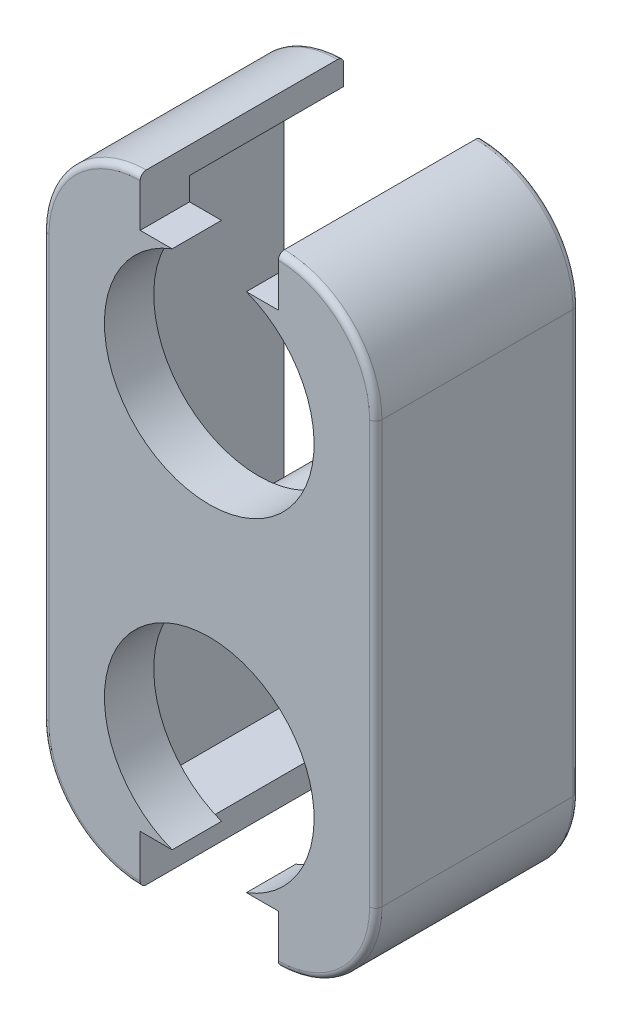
ISO-10303-21;
HEADER;
FILE_DESCRIPTION(('STEP AP214'),'2;1');
FILE_NAME('part.step','',(''),(''),'','','');
FILE_SCHEMA(('AUTOMOTIVE_DESIGN { 1 0 10303 214 1 1 1 1 }'));
ENDSEC;
DATA;
#1=APPLICATION_CONTEXT('core data for automotive mechanical design processes');
#2=APPLICATION_PROTOCOL_DEFINITION('international standard','automotive_design',2000,#1);
#3=PRODUCT_CONTEXT('',#1,'mechanical');
#4=PRODUCT('Part','Part','',(#3));
#5=PRODUCT_RELATED_PRODUCT_CATEGORY('part','',(#4));
#6=PRODUCT_DEFINITION_FORMATION('','',#4);
#7=PRODUCT_DEFINITION_CONTEXT('part definition',#1,'design');
#8=PRODUCT_DEFINITION('design','',#6,#7);
#9=PRODUCT_DEFINITION_SHAPE('','',#8);
#10=(LENGTH_UNIT() NAMED_UNIT(*) SI_UNIT(.MILLI.,.METRE.));
#11=(NAMED_UNIT(*) PLANE_ANGLE_UNIT() SI_UNIT($,.RADIAN.));
#12=(NAMED_UNIT(*) SI_UNIT($,.STERADIAN.) SOLID_ANGLE_UNIT());
#13=UNCERTAINTY_MEASURE_WITH_UNIT(LENGTH_MEASURE(1.E-05),#10,'distance_accuracy_value','');
#14=(GEOMETRIC_REPRESENTATION_CONTEXT(3) GLOBAL_UNCERTAINTY_ASSIGNED_CONTEXT((#13)) GLOBAL_UNIT_ASSIGNED_CONTEXT((#10,
#11,#12)) REPRESENTATION_CONTEXT('',''));
#15=CARTESIAN_POINT('',(0.,0.,0.));
#16=DIRECTION('',(0.,0.,1.));
#17=DIRECTION('',(1.,0.,0.));
#18=AXIS2_PLACEMENT_3D('',#15,#16,#17);
#19=CARTESIAN_POINT('',(0.,0.,0.));
#20=DIRECTION('',(0.,0.,1.));
#21=DIRECTION('',(1.,0.,0.));
#22=AXIS2_PLACEMENT_3D('',#19,#20,#21);
#23=PLANE('',#22);
#24=DIRECTION('',(1.,0.,0.));
#25=VECTOR('',#24,1.);
#26=CARTESIAN_POINT('',(-10.45,22.95,0.));
#27=LINE('',#26,#25);
#28=CARTESIAN_POINT('',(-10.1941253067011,22.95,0.));
#29=VERTEX_POINT('',#28);
#30=CARTESIAN_POINT('',(-5.6,22.95,0.));
#31=VERTEX_POINT('',#30);
#32=EDGE_CURVE('E299',#29,#31,#27,.T.);
#33=ORIENTED_EDGE('',*,*,#32,.F.);
#34=CARTESIAN_POINT('',(-5.5,17.100625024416,0.));
#35=DIRECTION('',(0.,0.,1.));
#36=DIRECTION('',(1.,0.,0.));
#37=AXIS2_PLACEMENT_3D('',#34,#35,#36);
#38=CIRCLE('',#37,7.5);
#39=CARTESIAN_POINT('',(-5.6,24.599958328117,0.));
#40=VERTEX_POINT('',#39);
#41=EDGE_CURVE('E658',#29,#40,#38,.F.);
#42=ORIENTED_EDGE('',*,*,#41,.T.);
#43=DIRECTION('',(0.,1.,0.));
#44=VECTOR('',#43,1.);
#45=CARTESIAN_POINT('',(-5.6,25.1,0.));
#46=LINE('',#45,#44);
#47=EDGE_CURVE('E357',#31,#40,#46,.T.);
#48=ORIENTED_EDGE('',*,*,#47,.F.);
#49=EDGE_LOOP('',(#33,#42,#48));
#50=FACE_BOUND('',#49,.T.);
#51=ADVANCED_FACE('F35',(#50),#23,.F.);
#52=DIRECTION('',(0.,1.,0.));
#53=VECTOR('',#52,1.);
#54=CARTESIAN_POINT('',(-5.6,-25.1,0.));
#55=LINE('',#54,#53);
#56=CARTESIAN_POINT('',(-5.6,-24.599958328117,0.));
#57=VERTEX_POINT('',#56);
#58=CARTESIAN_POINT('',(-5.6,-22.95,0.));
#59=VERTEX_POINT('',#58);
#60=EDGE_CURVE('E356',#57,#59,#55,.T.);
#61=ORIENTED_EDGE('',*,*,#60,.F.);
#62=CARTESIAN_POINT('',(-5.5,-17.100625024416,0.));
#63=DIRECTION('',(0.,0.,1.));
#64=DIRECTION('',(1.,0.,0.));
#65=AXIS2_PLACEMENT_3D('',#62,#63,#64);
#66=CIRCLE('',#65,7.5);
#67=CARTESIAN_POINT('',(-10.1941253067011,-22.95,0.));
#68=VERTEX_POINT('',#67);
#69=EDGE_CURVE('E656',#57,#68,#66,.F.);
#70=ORIENTED_EDGE('',*,*,#69,.T.);
#71=DIRECTION('',(-1.,0.,0.));
#72=VECTOR('',#71,1.);
#73=CARTESIAN_POINT('',(-10.45,-22.95,0.));
#74=LINE('',#73,#72);
#75=EDGE_CURVE('E311',#59,#68,#74,.T.);
#76=ORIENTED_EDGE('',*,*,#75,.F.);
#77=EDGE_LOOP('',(#61,#70,#76));
#78=FACE_BOUND('',#77,.T.);
#79=ADVANCED_FACE('F601',(#78),#23,.F.);
#80=CARTESIAN_POINT('',(10.1941253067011,-22.95,0.));
#81=VERTEX_POINT('',#80);
#82=CARTESIAN_POINT('',(5.6,-22.95,0.));
#83=VERTEX_POINT('',#82);
#84=EDGE_CURVE('E312',#81,#83,#74,.T.);
#85=ORIENTED_EDGE('',*,*,#84,.F.);
#86=CARTESIAN_POINT('',(5.5,-17.100625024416,0.));
#87=DIRECTION('',(0.,0.,1.));
#88=DIRECTION('',(1.,0.,0.));
#89=AXIS2_PLACEMENT_3D('',#86,#87,#88);
#90=CIRCLE('',#89,7.5);
#91=CARTESIAN_POINT('',(5.6,-24.599958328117,0.));
#92=VERTEX_POINT('',#91);
#93=EDGE_CURVE('E455',#81,#92,#90,.F.);
#94=ORIENTED_EDGE('',*,*,#93,.T.);
#95=DIRECTION('',(0.,-1.,0.));
#96=VECTOR('',#95,1.);
#97=CARTESIAN_POINT('',(5.6,-25.1,0.));
#98=LINE('',#97,#96);
#99=EDGE_CURVE('E361',#83,#92,#98,.T.);
#100=ORIENTED_EDGE('',*,*,#99,.F.);
#101=EDGE_LOOP('',(#85,#94,#100));
#102=FACE_BOUND('',#101,.T.);
#103=ADVANCED_FACE('F608',(#102),#23,.F.);
#104=DIRECTION('',(0.,-1.,0.));
#105=VECTOR('',#104,1.);
#106=CARTESIAN_POINT('',(5.6,25.1,0.));
#107=LINE('',#106,#105);
#108=CARTESIAN_POINT('',(5.6,24.599958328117,0.));
#109=VERTEX_POINT('',#108);
#110=CARTESIAN_POINT('',(5.6,22.95,0.));
#111=VERTEX_POINT('',#110);
#112=EDGE_CURVE('E360',#109,#111,#107,.T.);
#113=ORIENTED_EDGE('',*,*,#112,.F.);
#114=CARTESIAN_POINT('',(5.5,17.100625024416,0.));
#115=DIRECTION('',(0.,0.,1.));
#116=DIRECTION('',(1.,0.,0.));
#117=AXIS2_PLACEMENT_3D('',#114,#115,#116);
#118=CIRCLE('',#117,7.5);
#119=CARTESIAN_POINT('',(10.1941253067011,22.95,0.));
#120=VERTEX_POINT('',#119);
#121=EDGE_CURVE('E453',#109,#120,#118,.F.);
#122=ORIENTED_EDGE('',*,*,#121,.T.);
#123=EDGE_CURVE('E301',#111,#120,#27,.T.);
#124=ORIENTED_EDGE('',*,*,#123,.F.);
#125=EDGE_LOOP('',(#113,#122,#124));
#126=FACE_BOUND('',#125,.T.);
#127=ADVANCED_FACE('F627',(#126),#23,.F.);
#128=DIRECTION('',(0.,-1.,0.));
#129=VECTOR('',#128,1.);
#130=CARTESIAN_POINT('',(-13.,0.,0.));
#131=LINE('',#130,#129);
#132=CARTESIAN_POINT('',(-13.,-17.100625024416,0.));
#133=VERTEX_POINT('',#132);
#134=CARTESIAN_POINT('',(-13.,17.100625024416,0.));
#135=VERTEX_POINT('',#134);
#136=EDGE_CURVE('E638',#133,#135,#131,.F.);
#137=ORIENTED_EDGE('',*,*,#136,.T.);
#138=CARTESIAN_POINT('',(-5.5,17.100625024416,0.));
#139=DIRECTION('',(0.,0.,1.));
#140=DIRECTION('',(1.,0.,0.));
#141=AXIS2_PLACEMENT_3D('',#138,#139,#140);
#142=CIRCLE('',#141,7.5);
#143=CARTESIAN_POINT('',(-10.45,22.7351170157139,0.));
#144=VERTEX_POINT('',#143);
#145=EDGE_CURVE('E642',#135,#144,#142,.F.);
#146=ORIENTED_EDGE('',*,*,#145,.T.);
#147=DIRECTION('',(0.,1.,0.));
#148=VECTOR('',#147,1.);
#149=CARTESIAN_POINT('',(-10.45,22.95,0.));
#150=LINE('',#149,#148);
#151=CARTESIAN_POINT('',(-10.45,-22.7351170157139,0.));
#152=VERTEX_POINT('',#151);
#153=EDGE_CURVE('E314',#152,#144,#150,.T.);
#154=ORIENTED_EDGE('',*,*,#153,.F.);
#155=CARTESIAN_POINT('',(-5.5,-17.100625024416,0.));
#156=DIRECTION('',(0.,0.,1.));
#157=DIRECTION('',(1.,0.,0.));
#158=AXIS2_PLACEMENT_3D('',#155,#156,#157);
#159=CIRCLE('',#158,7.5);
#160=EDGE_CURVE('E644',#152,#133,#159,.F.);
#161=ORIENTED_EDGE('',*,*,#160,.T.);
#162=EDGE_LOOP('',(#137,#146,#154,#161));
#163=FACE_BOUND('',#162,.T.);
#164=ADVANCED_FACE('F617',(#163),#23,.F.);
#165=CARTESIAN_POINT('',(13.5,25.1,16.5));
#166=DIRECTION('',(-1.,0.,0.));
#167=DIRECTION('',(0.,-1.,0.));
#168=AXIS2_PLACEMENT_3D('',#165,#166,#167);
#169=PLANE('',#168);
#170=DIRECTION('',(0.,0.,-1.));
#171=VECTOR('',#170,1.);
#172=CARTESIAN_POINT('',(13.5,-17.100625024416,16.5));
#173=LINE('',#172,#171);
#174=CARTESIAN_POINT('',(13.5,-17.100625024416,16.));
#175=VERTEX_POINT('',#174);
#176=CARTESIAN_POINT('',(13.5,-17.100625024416,0.5));
#177=VERTEX_POINT('',#176);
#178=EDGE_CURVE('E437',#175,#177,#173,.T.);
#179=ORIENTED_EDGE('',*,*,#178,.T.);
#180=DIRECTION('',(0.,1.,0.));
#181=VECTOR('',#180,1.);
#182=CARTESIAN_POINT('',(13.5,25.1,0.5));
#183=LINE('',#182,#181);
#184=CARTESIAN_POINT('',(13.5,17.100625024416,0.5));
#185=VERTEX_POINT('',#184);
#186=EDGE_CURVE('E756',#177,#185,#183,.T.);
#187=ORIENTED_EDGE('',*,*,#186,.T.);
#188=DIRECTION('',(0.,0.,1.));
#189=VECTOR('',#188,1.);
#190=CARTESIAN_POINT('',(13.5,17.100625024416,16.5));
#191=LINE('',#190,#189);
#192=CARTESIAN_POINT('',(13.5,17.100625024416,16.));
#193=VERTEX_POINT('',#192);
#194=EDGE_CURVE('E434',#185,#193,#191,.T.);
#195=ORIENTED_EDGE('',*,*,#194,.T.);
#196=DIRECTION('',(0.,1.,0.));
#197=VECTOR('',#196,1.);
#198=CARTESIAN_POINT('',(13.5,-17.100625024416,16.));
#199=LINE('',#198,#197);
#200=EDGE_CURVE('E753',#193,#175,#199,.F.);
#201=ORIENTED_EDGE('',*,*,#200,.T.);
#202=EDGE_LOOP('',(#179,#187,#195,#201));
#203=FACE_BOUND('',#202,.T.);
#204=ADVANCED_FACE('F626',(#203),#169,.F.);
#205=CARTESIAN_POINT('',(-13.5,25.1,16.5));
#206=DIRECTION('',(1.,0.,0.));
#207=DIRECTION('',(0.,1.,0.));
#208=AXIS2_PLACEMENT_3D('',#205,#206,#207);
#209=PLANE('',#208);
#210=DIRECTION('',(0.,0.,-1.));
#211=VECTOR('',#210,1.);
#212=CARTESIAN_POINT('',(-13.5,17.100625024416,16.5));
#213=LINE('',#212,#211);
#214=CARTESIAN_POINT('',(-13.5,17.100625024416,16.));
#215=VERTEX_POINT('',#214);
#216=CARTESIAN_POINT('',(-13.5,17.100625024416,0.5));
#217=VERTEX_POINT('',#216);
#218=EDGE_CURVE('E440',#215,#217,#213,.T.);
#219=ORIENTED_EDGE('',*,*,#218,.T.);
#220=DIRECTION('',(0.,-1.,0.));
#221=VECTOR('',#220,1.);
#222=CARTESIAN_POINT('',(-13.5,25.1,0.5));
#223=LINE('',#222,#221);
#224=CARTESIAN_POINT('',(-13.5,-17.100625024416,0.5));
#225=VERTEX_POINT('',#224);
#226=EDGE_CURVE('E11',#217,#225,#223,.T.);
#227=ORIENTED_EDGE('',*,*,#226,.T.);
#228=DIRECTION('',(0.,0.,1.));
#229=VECTOR('',#228,1.);
#230=CARTESIAN_POINT('',(-13.5,-17.100625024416,16.5));
#231=LINE('',#230,#229);
#232=CARTESIAN_POINT('',(-13.5,-17.100625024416,16.));
#233=VERTEX_POINT('',#232);
#234=EDGE_CURVE('E443',#225,#233,#231,.T.);
#235=ORIENTED_EDGE('',*,*,#234,.T.);
#236=DIRECTION('',(0.,-1.,0.));
#237=VECTOR('',#236,1.);
#238=CARTESIAN_POINT('',(-13.5,17.100625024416,16.));
#239=LINE('',#238,#237);
#240=EDGE_CURVE('E45',#233,#215,#239,.F.);
#241=ORIENTED_EDGE('',*,*,#240,.T.);
#242=EDGE_LOOP('',(#219,#227,#235,#241));
#243=FACE_BOUND('',#242,.T.);
#244=ADVANCED_FACE('F624',(#243),#209,.F.);
#245=CARTESIAN_POINT('',(0.,0.,16.5));
#246=DIRECTION('',(0.,0.,1.));
#247=DIRECTION('',(1.,0.,0.));
#248=AXIS2_PLACEMENT_3D('',#245,#246,#247);
#249=PLANE('',#248);
#250=DIRECTION('',(0.,1.,0.));
#251=VECTOR('',#250,1.);
#252=CARTESIAN_POINT('',(5.6,-25.1,16.5));
#253=LINE('',#252,#251);
#254=CARTESIAN_POINT('',(5.6,-24.599958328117,16.5));
#255=VERTEX_POINT('',#254);
#256=CARTESIAN_POINT('',(5.6,-21.1,16.5));
#257=VERTEX_POINT('',#256);
#258=EDGE_CURVE('E394',#255,#257,#253,.T.);
#259=ORIENTED_EDGE('',*,*,#258,.F.);
#260=CARTESIAN_POINT('',(5.5,-17.100625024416,16.5));
#261=DIRECTION('',(0.,0.,1.));
#262=DIRECTION('',(1.,0.,0.));
#263=AXIS2_PLACEMENT_3D('',#260,#261,#262);
#264=CIRCLE('',#263,7.5);
#265=CARTESIAN_POINT('',(13.,-17.100625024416,16.5));
#266=VERTEX_POINT('',#265);
#267=EDGE_CURVE('E751',#255,#266,#264,.T.);
#268=ORIENTED_EDGE('',*,*,#267,.T.);
#269=DIRECTION('',(0.,1.,0.));
#270=VECTOR('',#269,1.);
#271=CARTESIAN_POINT('',(13.,17.100625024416,16.5));
#272=LINE('',#271,#270);
#273=CARTESIAN_POINT('',(13.,17.100625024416,16.5));
#274=VERTEX_POINT('',#273);
#275=EDGE_CURVE('E53',#266,#274,#272,.T.);
#276=ORIENTED_EDGE('',*,*,#275,.T.);
#277=CARTESIAN_POINT('',(5.5,17.100625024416,16.5));
#278=DIRECTION('',(0.,0.,1.));
#279=DIRECTION('',(1.,0.,0.));
#280=AXIS2_PLACEMENT_3D('',#277,#278,#279);
#281=CIRCLE('',#280,7.5);
#282=CARTESIAN_POINT('',(5.6,24.599958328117,16.5));
#283=VERTEX_POINT('',#282);
#284=EDGE_CURVE('E754',#274,#283,#281,.T.);
#285=ORIENTED_EDGE('',*,*,#284,.T.);
#286=DIRECTION('',(0.,1.,0.));
#287=VECTOR('',#286,1.);
#288=CARTESIAN_POINT('',(5.6,25.1,16.5));
#289=LINE('',#288,#287);
#290=CARTESIAN_POINT('',(5.6,21.1,16.5));
#291=VERTEX_POINT('',#290);
#292=EDGE_CURVE('E363',#291,#283,#289,.T.);
#293=ORIENTED_EDGE('',*,*,#292,.F.);
#294=DIRECTION('',(1.,0.,0.));
#295=VECTOR('',#294,1.);
#296=CARTESIAN_POINT('',(5.6,21.1,16.5));
#297=LINE('',#296,#295);
#298=CARTESIAN_POINT('',(3.00790624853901,21.1,16.5));
#299=VERTEX_POINT('',#298);
#300=EDGE_CURVE('E374',#299,#291,#297,.T.);
#301=ORIENTED_EDGE('',*,*,#300,.F.);
#302=CARTESIAN_POINT('',(0.,13.15,16.5));
#303=DIRECTION('',(0.,0.,1.));
#304=DIRECTION('',(1.,0.,0.));
#305=AXIS2_PLACEMENT_3D('',#302,#303,#304);
#306=CIRCLE('',#305,8.5);
#307=CARTESIAN_POINT('',(-3.00790624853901,21.1,16.5));
#308=VERTEX_POINT('',#307);
#309=EDGE_CURVE('E371',#308,#299,#306,.T.);
#310=ORIENTED_EDGE('',*,*,#309,.F.);
#311=DIRECTION('',(1.,0.,0.));
#312=VECTOR('',#311,1.);
#313=CARTESIAN_POINT('',(-3.00790624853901,21.1,16.5));
#314=LINE('',#313,#312);
#315=CARTESIAN_POINT('',(-5.6,21.1,16.5));
#316=VERTEX_POINT('',#315);
#317=EDGE_CURVE('E368',#316,#308,#314,.T.);
#318=ORIENTED_EDGE('',*,*,#317,.F.);
#319=DIRECTION('',(0.,-1.,0.));
#320=VECTOR('',#319,1.);
#321=CARTESIAN_POINT('',(-5.6,25.1,16.5));
#322=LINE('',#321,#320);
#323=CARTESIAN_POINT('',(-5.6,24.599958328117,16.5));
#324=VERTEX_POINT('',#323);
#325=EDGE_CURVE('E366',#324,#316,#322,.T.);
#326=ORIENTED_EDGE('',*,*,#325,.F.);
#327=CARTESIAN_POINT('',(-5.5,17.100625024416,16.5));
#328=DIRECTION('',(0.,0.,1.));
#329=DIRECTION('',(1.,0.,0.));
#330=AXIS2_PLACEMENT_3D('',#327,#328,#329);
#331=CIRCLE('',#330,7.5);
#332=CARTESIAN_POINT('',(-13.,17.100625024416,16.5));
#333=VERTEX_POINT('',#332);
#334=EDGE_CURVE('E786',#324,#333,#331,.T.);
#335=ORIENTED_EDGE('',*,*,#334,.T.);
#336=DIRECTION('',(0.,-1.,0.));
#337=VECTOR('',#336,1.);
#338=CARTESIAN_POINT('',(-13.,-17.100625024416,16.5));
#339=LINE('',#338,#337);
#340=CARTESIAN_POINT('',(-13.,-17.100625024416,16.5));
#341=VERTEX_POINT('',#340);
#342=EDGE_CURVE('E779',#333,#341,#339,.T.);
#343=ORIENTED_EDGE('',*,*,#342,.T.);
#344=CARTESIAN_POINT('',(-5.5,-17.100625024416,16.5));
#345=DIRECTION('',(0.,0.,1.));
#346=DIRECTION('',(1.,0.,0.));
#347=AXIS2_PLACEMENT_3D('',#344,#345,#346);
#348=CIRCLE('',#347,7.5);
#349=CARTESIAN_POINT('',(-5.6,-24.599958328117,16.5));
#350=VERTEX_POINT('',#349);
#351=EDGE_CURVE('E784',#341,#350,#348,.T.);
#352=ORIENTED_EDGE('',*,*,#351,.T.);
#353=DIRECTION('',(0.,-1.,0.));
#354=VECTOR('',#353,1.);
#355=CARTESIAN_POINT('',(-5.6,-25.1,16.5));
#356=LINE('',#355,#354);
#357=CARTESIAN_POINT('',(-5.6,-21.1,16.5));
#358=VERTEX_POINT('',#357);
#359=EDGE_CURVE('E405',#358,#350,#356,.T.);
#360=ORIENTED_EDGE('',*,*,#359,.F.);
#361=DIRECTION('',(-1.,0.,0.));
#362=VECTOR('',#361,1.);
#363=CARTESIAN_POINT('',(-3.00790624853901,-21.1,16.5));
#364=LINE('',#363,#362);
#365=CARTESIAN_POINT('',(-3.007906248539,-21.1,16.5));
#366=VERTEX_POINT('',#365);
#367=EDGE_CURVE('E402',#366,#358,#364,.T.);
#368=ORIENTED_EDGE('',*,*,#367,.F.);
#369=CARTESIAN_POINT('',(0.,-13.15,16.5));
#370=DIRECTION('',(0.,0.,1.));
#371=DIRECTION('',(1.,0.,0.));
#372=AXIS2_PLACEMENT_3D('',#369,#370,#371);
#373=CIRCLE('',#372,8.5);
#374=CARTESIAN_POINT('',(3.00790624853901,-21.1,16.5));
#375=VERTEX_POINT('',#374);
#376=EDGE_CURVE('E399',#375,#366,#373,.T.);
#377=ORIENTED_EDGE('',*,*,#376,.F.);
#378=DIRECTION('',(-1.,0.,0.));
#379=VECTOR('',#378,1.);
#380=CARTESIAN_POINT('',(5.6,-21.1,16.5));
#381=LINE('',#380,#379);
#382=EDGE_CURVE('E396',#257,#375,#381,.T.);
#383=ORIENTED_EDGE('',*,*,#382,.F.);
#384=EDGE_LOOP('',(#259,#268,#276,#285,#293,#301,#310,#318,#326,#335,#343,#352,#360,#368,#377,#383));
#385=FACE_BOUND('',#384,.T.);
#386=ADVANCED_FACE('F615',(#385),#249,.T.);
#387=DIRECTION('',(0.,1.,0.));
#388=VECTOR('',#387,1.);
#389=CARTESIAN_POINT('',(13.,0.,0.));
#390=LINE('',#389,#388);
#391=CARTESIAN_POINT('',(13.,17.100625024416,0.));
#392=VERTEX_POINT('',#391);
#393=CARTESIAN_POINT('',(13.,-17.100625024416,0.));
#394=VERTEX_POINT('',#393);
#395=EDGE_CURVE('E446',#392,#394,#390,.F.);
#396=ORIENTED_EDGE('',*,*,#395,.T.);
#397=CARTESIAN_POINT('',(5.5,-17.100625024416,0.));
#398=DIRECTION('',(0.,0.,1.));
#399=DIRECTION('',(1.,0.,0.));
#400=AXIS2_PLACEMENT_3D('',#397,#398,#399);
#401=CIRCLE('',#400,7.5);
#402=CARTESIAN_POINT('',(10.45,-22.7351170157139,0.));
#403=VERTEX_POINT('',#402);
#404=EDGE_CURVE('E450',#394,#403,#401,.F.);
#405=ORIENTED_EDGE('',*,*,#404,.T.);
#406=DIRECTION('',(0.,-1.,0.));
#407=VECTOR('',#406,1.);
#408=CARTESIAN_POINT('',(10.45,22.95,0.));
#409=LINE('',#408,#407);
#410=CARTESIAN_POINT('',(10.45,22.7351170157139,0.));
#411=VERTEX_POINT('',#410);
#412=EDGE_CURVE('E309',#411,#403,#409,.T.);
#413=ORIENTED_EDGE('',*,*,#412,.F.);
#414=CARTESIAN_POINT('',(5.5,17.100625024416,0.));
#415=DIRECTION('',(0.,0.,1.));
#416=DIRECTION('',(1.,0.,0.));
#417=AXIS2_PLACEMENT_3D('',#414,#415,#416);
#418=CIRCLE('',#417,7.5);
#419=EDGE_CURVE('E448',#411,#392,#418,.F.);
#420=ORIENTED_EDGE('',*,*,#419,.T.);
#421=EDGE_LOOP('',(#396,#405,#413,#420));
#422=FACE_BOUND('',#421,.T.);
#423=ADVANCED_FACE('F604',(#422),#23,.F.);
#424=CARTESIAN_POINT('',(-5.6,-25.1,-0.001000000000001));
#425=DIRECTION('',(-1.,0.,0.));
#426=DIRECTION('',(0.,0.,1.));
#427=AXIS2_PLACEMENT_3D('',#424,#425,#426);
#428=PLANE('',#427);
#429=DIRECTION('',(0.,0.,1.));
#430=VECTOR('',#429,1.);
#431=CARTESIAN_POINT('',(-5.6,-25.1,-0.001000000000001));
#432=LINE('',#431,#430);
#433=CARTESIAN_POINT('',(-5.6,-25.1,0.5));
#434=VERTEX_POINT('',#433);
#435=CARTESIAN_POINT('',(-5.6,-25.1,16.));
#436=VERTEX_POINT('',#435);
#437=EDGE_CURVE('E409',#434,#436,#432,.T.);
#438=ORIENTED_EDGE('',*,*,#437,.F.);
#439=CARTESIAN_POINT('',(-5.6,-25.1,0.5));
#440=CARTESIAN_POINT('',(-5.6,-25.1000238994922,0.471872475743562));
#441=CARTESIAN_POINT('',(-5.6,-25.0976277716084,0.443752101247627));
#442=CARTESIAN_POINT('',(-5.6,-25.0881718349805,0.388328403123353));
#443=CARTESIAN_POINT('',(-5.6,-25.0811156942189,0.361024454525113));
#444=CARTESIAN_POINT('',(-5.6,-25.0625111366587,0.307976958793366));
#445=CARTESIAN_POINT('',(-5.6,-25.0509605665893,0.282234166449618));
#446=CARTESIAN_POINT('',(-5.6,-25.0237052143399,0.233057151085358));
#447=CARTESIAN_POINT('',(-5.6,-25.0080011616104,0.20962252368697));
#448=CARTESIAN_POINT('',(-5.6,-24.9728815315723,0.165721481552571));
#449=CARTESIAN_POINT('',(-5.6,-24.9534658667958,0.145255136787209));
#450=CARTESIAN_POINT('',(-5.6,-24.911469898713,0.107868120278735));
#451=CARTESIAN_POINT('',(-5.6,-24.8888889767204,0.0909481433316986));
#452=CARTESIAN_POINT('',(-5.6,-24.8412032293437,0.0611354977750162));
#453=CARTESIAN_POINT('',(-5.6,-24.8160977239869,0.0482439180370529));
#454=CARTESIAN_POINT('',(-5.6,-24.7640837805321,0.0268648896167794));
#455=CARTESIAN_POINT('',(-5.6,-24.7371764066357,0.0183748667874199));
#456=CARTESIAN_POINT('',(-5.6,-24.6917468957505,0.00814831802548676));
#457=CARTESIAN_POINT('',(-5.6,-24.6735103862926,0.00509454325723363));
#458=CARTESIAN_POINT('',(-5.6,-24.6368379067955,0.0010206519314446));
#459=CARTESIAN_POINT('',(-5.6,-24.6184022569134,-2.34748073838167E-06));
#460=CARTESIAN_POINT('',(-5.6,-24.599958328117,0.));
#461=B_SPLINE_CURVE_WITH_KNOTS('',3,(#439,#440,#441,#442,#443,#444,#445,#446,#447,#448,#449,
#450,#451,#452,#453,#454,#455,#456,#457,#458,#459,#460),.UNSPECIFIED.,.F.,.F.,(4,2,2,2,2,2,2,2,
2,2,4),(0.,0.0842704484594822,0.168474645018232,0.252719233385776,0.336949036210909,
0.421180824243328,0.505429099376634,0.589700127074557,0.673921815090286,0.729287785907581,
0.78457510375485),.UNSPECIFIED.);
#462=EDGE_CURVE('E693',#434,#57,#461,.T.);
#463=ORIENTED_EDGE('',*,*,#462,.T.);
#464=ORIENTED_EDGE('',*,*,#60,.T.);
#465=DIRECTION('',(0.,0.,1.));
#466=VECTOR('',#465,1.);
#467=CARTESIAN_POINT('',(-5.6,-22.95,-0.001000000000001));
#468=LINE('',#467,#466);
#469=CARTESIAN_POINT('',(-5.6,-22.95,12.5));
#470=VERTEX_POINT('',#469);
#471=EDGE_CURVE('E353',#59,#470,#468,.T.);
#472=ORIENTED_EDGE('',*,*,#471,.T.);
#473=DIRECTION('',(0.,1.,0.));
#474=VECTOR('',#473,1.);
#475=CARTESIAN_POINT('',(-5.6,-25.1,12.5));
#476=LINE('',#475,#474);
#477=CARTESIAN_POINT('',(-5.6,-21.1,12.5));
#478=VERTEX_POINT('',#477);
#479=EDGE_CURVE('E347',#470,#478,#476,.T.);
#480=ORIENTED_EDGE('',*,*,#479,.T.);
#481=DIRECTION('',(0.,0.,1.));
#482=VECTOR('',#481,1.);
#483=CARTESIAN_POINT('',(-5.6,-21.1,-0.001000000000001));
#484=LINE('',#483,#482);
#485=EDGE_CURVE('E412',#478,#358,#484,.T.);
#486=ORIENTED_EDGE('',*,*,#485,.T.);
#487=ORIENTED_EDGE('',*,*,#359,.T.);
#488=CARTESIAN_POINT('',(-5.6,-24.599958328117,16.5));
#489=CARTESIAN_POINT('',(-5.6,-24.6280915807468,16.5000238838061));
#490=CARTESIAN_POINT('',(-5.6,-24.6562177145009,16.4976274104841));
#491=CARTESIAN_POINT('',(-5.6,-24.7116529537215,16.4881699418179));
#492=CARTESIAN_POINT('',(-5.6,-24.7389626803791,16.4811125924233));
#493=CARTESIAN_POINT('',(-5.6,-24.7920214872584,16.4625045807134));
#494=CARTESIAN_POINT('',(-5.6,-24.8177698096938,16.4509517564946));
#495=CARTESIAN_POINT('',(-5.6,-24.8669571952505,16.4236906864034));
#496=CARTESIAN_POINT('',(-5.6,-24.8903966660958,16.4079831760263));
#497=CARTESIAN_POINT('',(-5.6,-24.9343045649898,16.3728566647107));
#498=CARTESIAN_POINT('',(-5.6,-24.9547731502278,16.3534378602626));
#499=CARTESIAN_POINT('',(-5.6,-24.9921634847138,16.31143479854));
#500=CARTESIAN_POINT('',(-5.6,-25.0090845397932,16.2888499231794));
#501=CARTESIAN_POINT('',(-5.6,-25.0388953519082,16.2411592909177));
#502=CARTESIAN_POINT('',(-5.6,-25.0517846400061,16.2160532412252));
#503=CARTESIAN_POINT('',(-5.6,-25.073158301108,16.1640384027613));
#504=CARTESIAN_POINT('',(-5.6,-25.0816452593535,16.137130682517));
#505=CARTESIAN_POINT('',(-5.6,-25.0918627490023,16.0917150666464));
#506=CARTESIAN_POINT('',(-5.6,-25.0949123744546,16.0734930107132));
#507=CARTESIAN_POINT('',(-5.6,-25.0989807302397,16.0368498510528));
#508=CARTESIAN_POINT('',(-5.6,-25.100002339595,16.0184290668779));
#509=CARTESIAN_POINT('',(-5.6,-25.1,16.));
#510=B_SPLINE_CURVE_WITH_KNOTS('',3,(#488,#489,#490,#491,#492,#493,#494,#495,#496,#497,#498,
#499,#500,#501,#502,#503,#504,#505,#506,#507,#508,#509),.UNSPECIFIED.,.F.,.F.,(4,2,2,2,2,2,2,2,
2,2,4),(0.,0.0842876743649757,0.168509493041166,0.252771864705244,0.337019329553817,
0.421262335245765,0.505521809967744,0.589791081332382,0.674010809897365,0.729332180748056,
0.784574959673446),.UNSPECIFIED.);
#511=EDGE_CURVE('E688',#350,#436,#510,.T.);
#512=ORIENTED_EDGE('',*,*,#511,.T.);
#513=EDGE_LOOP('',(#438,#463,#464,#472,#480,#486,#487,#512));
#514=FACE_BOUND('',#513,.T.);
#515=ADVANCED_FACE('F614',(#514),#428,.F.);
#516=CARTESIAN_POINT('',(-3.00790624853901,-21.1,-0.001000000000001));
#517=DIRECTION('',(0.,1.,0.));
#518=DIRECTION('',(0.,0.,1.));
#519=AXIS2_PLACEMENT_3D('',#516,#517,#518);
#520=PLANE('',#519);
#521=ORIENTED_EDGE('',*,*,#485,.F.);
#522=DIRECTION('',(1.,0.,0.));
#523=VECTOR('',#522,1.);
#524=CARTESIAN_POINT('',(-3.00790624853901,-21.1,12.5));
#525=LINE('',#524,#523);
#526=CARTESIAN_POINT('',(-3.007906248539,-21.1,12.5));
#527=VERTEX_POINT('',#526);
#528=EDGE_CURVE('E344',#478,#527,#525,.T.);
#529=ORIENTED_EDGE('',*,*,#528,.T.);
#530=DIRECTION('',(0.,0.,1.));
#531=VECTOR('',#530,1.);
#532=CARTESIAN_POINT('',(-3.007906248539,-21.1,-0.001000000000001));
#533=LINE('',#532,#531);
#534=EDGE_CURVE('E414',#527,#366,#533,.T.);
#535=ORIENTED_EDGE('',*,*,#534,.T.);
#536=ORIENTED_EDGE('',*,*,#367,.T.);
#537=EDGE_LOOP('',(#521,#529,#535,#536));
#538=FACE_BOUND('',#537,.T.);
#539=ADVANCED_FACE('F622',(#538),#520,.F.);
#540=CARTESIAN_POINT('',(0.,-13.15,-0.001000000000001));
#541=DIRECTION('',(0.,0.,1.));
#542=DIRECTION('',(1.,0.,0.));
#543=AXIS2_PLACEMENT_3D('',#540,#541,#542);
#544=CYLINDRICAL_SURFACE('',#543,8.5);
#545=ORIENTED_EDGE('',*,*,#534,.F.);
#546=CARTESIAN_POINT('',(0.,-13.15,12.5));
#547=DIRECTION('',(0.,0.,1.));
#548=DIRECTION('',(1.,0.,0.));
#549=AXIS2_PLACEMENT_3D('',#546,#547,#548);
#550=CIRCLE('',#549,8.5);
#551=CARTESIAN_POINT('',(3.00790624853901,-21.1,12.5));
#552=VERTEX_POINT('',#551);
#553=EDGE_CURVE('E341',#527,#552,#550,.F.);
#554=ORIENTED_EDGE('',*,*,#553,.T.);
#555=DIRECTION('',(0.,0.,1.));
#556=VECTOR('',#555,1.);
#557=CARTESIAN_POINT('',(3.00790624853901,-21.1,-0.001000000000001));
#558=LINE('',#557,#556);
#559=EDGE_CURVE('E416',#552,#375,#558,.T.);
#560=ORIENTED_EDGE('',*,*,#559,.T.);
#561=ORIENTED_EDGE('',*,*,#376,.T.);
#562=EDGE_LOOP('',(#545,#554,#560,#561));
#563=FACE_BOUND('',#562,.T.);
#564=ADVANCED_FACE('F704',(#563),#544,.F.);
#565=CARTESIAN_POINT('',(5.6,-21.1,-0.001000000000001));
#566=DIRECTION('',(0.,1.,0.));
#567=DIRECTION('',(0.,0.,1.));
#568=AXIS2_PLACEMENT_3D('',#565,#566,#567);
#569=PLANE('',#568);
#570=ORIENTED_EDGE('',*,*,#559,.F.);
#571=DIRECTION('',(1.,0.,0.));
#572=VECTOR('',#571,1.);
#573=CARTESIAN_POINT('',(5.6,-21.1,12.5));
#574=LINE('',#573,#572);
#575=CARTESIAN_POINT('',(5.6,-21.1,12.5));
#576=VERTEX_POINT('',#575);
#577=EDGE_CURVE('E338',#552,#576,#574,.T.);
#578=ORIENTED_EDGE('',*,*,#577,.T.);
#579=DIRECTION('',(0.,0.,1.));
#580=VECTOR('',#579,1.);
#581=CARTESIAN_POINT('',(5.6,-21.1,-0.001000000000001));
#582=LINE('',#581,#580);
#583=EDGE_CURVE('E418',#576,#257,#582,.T.);
#584=ORIENTED_EDGE('',*,*,#583,.T.);
#585=ORIENTED_EDGE('',*,*,#382,.T.);
#586=EDGE_LOOP('',(#570,#578,#584,#585));
#587=FACE_BOUND('',#586,.T.);
#588=ADVANCED_FACE('F708',(#587),#569,.F.);
#589=CARTESIAN_POINT('',(5.6,-25.1,-0.001000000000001));
#590=DIRECTION('',(1.,0.,0.));
#591=DIRECTION('',(0.,1.,0.));
#592=AXIS2_PLACEMENT_3D('',#589,#590,#591);
#593=PLANE('',#592);
#594=ORIENTED_EDGE('',*,*,#99,.T.);
#595=CARTESIAN_POINT('',(5.6,-24.599958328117,0.));
#596=CARTESIAN_POINT('',(5.6,-24.6280915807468,-2.38838060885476E-05));
#597=CARTESIAN_POINT('',(5.6,-24.6562177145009,0.00237258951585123));
#598=CARTESIAN_POINT('',(5.6,-24.7116529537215,0.0118300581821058));
#599=CARTESIAN_POINT('',(5.6,-24.7389626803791,0.0188874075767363));
#600=CARTESIAN_POINT('',(5.6,-24.7920214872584,0.0374954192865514));
#601=CARTESIAN_POINT('',(5.6,-24.8177698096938,0.0490482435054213));
#602=CARTESIAN_POINT('',(5.6,-24.8669571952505,0.0763093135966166));
#603=CARTESIAN_POINT('',(5.6,-24.8903966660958,0.092016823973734));
#604=CARTESIAN_POINT('',(5.6,-24.9343045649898,0.127143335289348));
#605=CARTESIAN_POINT('',(5.6,-24.9547731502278,0.146562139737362));
#606=CARTESIAN_POINT('',(5.6,-24.9921634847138,0.188565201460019));
#607=CARTESIAN_POINT('',(5.6,-25.0090845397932,0.211150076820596));
#608=CARTESIAN_POINT('',(5.6,-25.0388953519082,0.258840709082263));
#609=CARTESIAN_POINT('',(5.6,-25.0517846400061,0.283946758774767));
#610=CARTESIAN_POINT('',(5.6,-25.073158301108,0.335961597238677));
#611=CARTESIAN_POINT('',(5.6,-25.0816452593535,0.362869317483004));
#612=CARTESIAN_POINT('',(5.6,-25.0918627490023,0.408284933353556));
#613=CARTESIAN_POINT('',(5.6,-25.0949123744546,0.426506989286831));
#614=CARTESIAN_POINT('',(5.6,-25.0989807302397,0.46315014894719));
#615=CARTESIAN_POINT('',(5.6,-25.100002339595,0.481570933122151));
#616=CARTESIAN_POINT('',(5.6,-25.1,0.500000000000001));
#617=B_SPLINE_CURVE_WITH_KNOTS('',3,(#595,#596,#597,#598,#599,#600,#601,#602,#603,#604,#605,
#606,#607,#608,#609,#610,#611,#612,#613,#614,#615,#616),.UNSPECIFIED.,.F.,.F.,(4,2,2,2,2,2,2,2,
2,2,4),(0.,0.0842876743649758,0.168509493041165,0.252771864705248,0.337019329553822,
0.421262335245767,0.505521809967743,0.58979108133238,0.674010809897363,0.729332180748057,
0.784574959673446),.UNSPECIFIED.);
#618=CARTESIAN_POINT('',(5.6,-25.1,0.5));
#619=VERTEX_POINT('',#618);
#620=EDGE_CURVE('E725',#92,#619,#617,.T.);
#621=ORIENTED_EDGE('',*,*,#620,.T.);
#622=DIRECTION('',(0.,0.,1.));
#623=VECTOR('',#622,1.);
#624=CARTESIAN_POINT('',(5.6,-25.1,-0.001000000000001));
#625=LINE('',#624,#623);
#626=CARTESIAN_POINT('',(5.6,-25.1,16.));
#627=VERTEX_POINT('',#626);
#628=EDGE_CURVE('E408',#619,#627,#625,.T.);
#629=ORIENTED_EDGE('',*,*,#628,.T.);
#630=CARTESIAN_POINT('',(5.6,-25.1,16.));
#631=CARTESIAN_POINT('',(5.6,-25.1000238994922,16.0281275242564));
#632=CARTESIAN_POINT('',(5.6,-25.0976277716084,16.0562478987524));
#633=CARTESIAN_POINT('',(5.6,-25.0881718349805,16.1116715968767));
#634=CARTESIAN_POINT('',(5.6,-25.0811156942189,16.1389755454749));
#635=CARTESIAN_POINT('',(5.6,-25.0625111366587,16.1920230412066));
#636=CARTESIAN_POINT('',(5.6,-25.0509605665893,16.2177658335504));
#637=CARTESIAN_POINT('',(5.6,-25.0237052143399,16.2669428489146));
#638=CARTESIAN_POINT('',(5.6,-25.0080011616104,16.290377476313));
#639=CARTESIAN_POINT('',(5.6,-24.9728815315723,16.3342785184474));
#640=CARTESIAN_POINT('',(5.6,-24.9534658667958,16.3547448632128));
#641=CARTESIAN_POINT('',(5.6,-24.911469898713,16.3921318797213));
#642=CARTESIAN_POINT('',(5.6,-24.8888889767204,16.4090518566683));
#643=CARTESIAN_POINT('',(5.6,-24.8412032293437,16.438864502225));
#644=CARTESIAN_POINT('',(5.6,-24.8160977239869,16.4517560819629));
#645=CARTESIAN_POINT('',(5.6,-24.7640837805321,16.4731351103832));
#646=CARTESIAN_POINT('',(5.6,-24.7371764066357,16.4816251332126));
#647=CARTESIAN_POINT('',(5.6,-24.6917468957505,16.4918516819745));
#648=CARTESIAN_POINT('',(5.6,-24.6735103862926,16.4949054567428));
#649=CARTESIAN_POINT('',(5.6,-24.6368379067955,16.4989793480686));
#650=CARTESIAN_POINT('',(5.6,-24.6184022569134,16.5000023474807));
#651=CARTESIAN_POINT('',(5.6,-24.599958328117,16.5));
#652=B_SPLINE_CURVE_WITH_KNOTS('',3,(#630,#631,#632,#633,#634,#635,#636,#637,#638,#639,#640,
#641,#642,#643,#644,#645,#646,#647,#648,#649,#650,#651),.UNSPECIFIED.,.F.,.F.,(4,2,2,2,2,2,2,2,
2,2,4),(0.,0.084270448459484,0.168474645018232,0.252719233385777,0.336949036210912,
0.42118082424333,0.505429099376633,0.589700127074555,0.673921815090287,0.729287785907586,
0.78457510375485),.UNSPECIFIED.);
#653=EDGE_CURVE('E719',#627,#255,#652,.T.);
#654=ORIENTED_EDGE('',*,*,#653,.T.);
#655=ORIENTED_EDGE('',*,*,#258,.T.);
#656=ORIENTED_EDGE('',*,*,#583,.F.);
#657=DIRECTION('',(0.,-1.,0.));
#658=VECTOR('',#657,1.);
#659=CARTESIAN_POINT('',(5.6,-25.1,12.5));
#660=LINE('',#659,#658);
#661=CARTESIAN_POINT('',(5.6,-22.95,12.5));
#662=VERTEX_POINT('',#661);
#663=EDGE_CURVE('E336',#576,#662,#660,.T.);
#664=ORIENTED_EDGE('',*,*,#663,.T.);
#665=DIRECTION('',(0.,0.,-1.));
#666=VECTOR('',#665,1.);
#667=CARTESIAN_POINT('',(5.6,-22.95,-0.001000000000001));
#668=LINE('',#667,#666);
#669=EDGE_CURVE('E289',#662,#83,#668,.T.);
#670=ORIENTED_EDGE('',*,*,#669,.T.);
#671=EDGE_LOOP('',(#594,#621,#629,#654,#655,#656,#664,#670));
#672=FACE_BOUND('',#671,.T.);
#673=ADVANCED_FACE('F712',(#672),#593,.F.);
#674=CARTESIAN_POINT('',(5.6,25.1,-0.001000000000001));
#675=DIRECTION('',(1.,0.,0.));
#676=DIRECTION('',(0.,1.,0.));
#677=AXIS2_PLACEMENT_3D('',#674,#675,#676);
#678=PLANE('',#677);
#679=DIRECTION('',(0.,0.,1.));
#680=VECTOR('',#679,1.);
#681=CARTESIAN_POINT('',(5.6,25.1,-0.001000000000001));
#682=LINE('',#681,#680);
#683=CARTESIAN_POINT('',(5.6,25.1,0.5));
#684=VERTEX_POINT('',#683);
#685=CARTESIAN_POINT('',(5.6,25.1,16.));
#686=VERTEX_POINT('',#685);
#687=EDGE_CURVE('E377',#684,#686,#682,.T.);
#688=ORIENTED_EDGE('',*,*,#687,.F.);
#689=CARTESIAN_POINT('',(5.6,25.1,0.5));
#690=CARTESIAN_POINT('',(5.6,25.1000238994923,0.471872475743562));
#691=CARTESIAN_POINT('',(5.6,25.0976277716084,0.443752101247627));
#692=CARTESIAN_POINT('',(5.6,25.0881718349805,0.388328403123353));
#693=CARTESIAN_POINT('',(5.6,25.0811156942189,0.361024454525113));
#694=CARTESIAN_POINT('',(5.6,25.0625111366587,0.307976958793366));
#695=CARTESIAN_POINT('',(5.6,25.0509605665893,0.282234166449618));
#696=CARTESIAN_POINT('',(5.6,25.0237052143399,0.233057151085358));
#697=CARTESIAN_POINT('',(5.6,25.0080011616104,0.20962252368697));
#698=CARTESIAN_POINT('',(5.6,24.9728815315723,0.165721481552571));
#699=CARTESIAN_POINT('',(5.6,24.9534658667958,0.145255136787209));
#700=CARTESIAN_POINT('',(5.6,24.911469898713,0.107868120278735));
#701=CARTESIAN_POINT('',(5.6,24.8888889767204,0.0909481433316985));
#702=CARTESIAN_POINT('',(5.6,24.8412032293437,0.0611354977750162));
#703=CARTESIAN_POINT('',(5.6,24.8160977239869,0.0482439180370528));
#704=CARTESIAN_POINT('',(5.6,24.7640837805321,0.0268648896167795));
#705=CARTESIAN_POINT('',(5.6,24.7371764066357,0.01837486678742));
#706=CARTESIAN_POINT('',(5.6,24.6917468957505,0.00814831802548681));
#707=CARTESIAN_POINT('',(5.6,24.6735103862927,0.0050945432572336));
#708=CARTESIAN_POINT('',(5.6,24.6368379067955,0.00102065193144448));
#709=CARTESIAN_POINT('',(5.6,24.6184022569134,-2.34748073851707E-06));
#710=CARTESIAN_POINT('',(5.6,24.599958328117,0.));
#711=B_SPLINE_CURVE_WITH_KNOTS('',3,(#689,#690,#691,#692,#693,#694,#695,#696,#697,#698,#699,
#700,#701,#702,#703,#704,#705,#706,#707,#708,#709,#710),.UNSPECIFIED.,.F.,.F.,(4,2,2,2,2,2,2,2,
2,2,4),(0.,0.0842704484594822,0.168474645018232,0.252719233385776,0.336949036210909,
0.421180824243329,0.505429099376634,0.589700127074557,0.673921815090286,0.729287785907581,
0.78457510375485),.UNSPECIFIED.);
#712=EDGE_CURVE('E575',#684,#109,#711,.T.);
#713=ORIENTED_EDGE('',*,*,#712,.T.);
#714=ORIENTED_EDGE('',*,*,#112,.T.);
#715=DIRECTION('',(0.,0.,1.));
#716=VECTOR('',#715,1.);
#717=CARTESIAN_POINT('',(5.6,22.95,-0.001000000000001));
#718=LINE('',#717,#716);
#719=CARTESIAN_POINT('',(5.6,22.95,12.5));
#720=VERTEX_POINT('',#719);
#721=EDGE_CURVE('E350',#111,#720,#718,.T.);
#722=ORIENTED_EDGE('',*,*,#721,.T.);
#723=DIRECTION('',(0.,-1.,0.));
#724=VECTOR('',#723,1.);
#725=CARTESIAN_POINT('',(5.6,25.1,12.5));
#726=LINE('',#725,#724);
#727=CARTESIAN_POINT('',(5.6,21.1,12.5));
#728=VERTEX_POINT('',#727);
#729=EDGE_CURVE('E333',#720,#728,#726,.T.);
#730=ORIENTED_EDGE('',*,*,#729,.T.);
#731=DIRECTION('',(0.,0.,1.));
#732=VECTOR('',#731,1.);
#733=CARTESIAN_POINT('',(5.6,21.1,-0.001000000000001));
#734=LINE('',#733,#732);
#735=EDGE_CURVE('E378',#728,#291,#734,.T.);
#736=ORIENTED_EDGE('',*,*,#735,.T.);
#737=ORIENTED_EDGE('',*,*,#292,.T.);
#738=CARTESIAN_POINT('',(5.6,24.599958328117,16.5));
#739=CARTESIAN_POINT('',(5.6,24.6280915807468,16.5000238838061));
#740=CARTESIAN_POINT('',(5.6,24.6562177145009,16.4976274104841));
#741=CARTESIAN_POINT('',(5.6,24.7116529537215,16.4881699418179));
#742=CARTESIAN_POINT('',(5.6,24.7389626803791,16.4811125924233));
#743=CARTESIAN_POINT('',(5.6,24.7920214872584,16.4625045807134));
#744=CARTESIAN_POINT('',(5.6,24.8177698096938,16.4509517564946));
#745=CARTESIAN_POINT('',(5.6,24.8669571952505,16.4236906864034));
#746=CARTESIAN_POINT('',(5.6,24.8903966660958,16.4079831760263));
#747=CARTESIAN_POINT('',(5.6,24.9343045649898,16.3728566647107));
#748=CARTESIAN_POINT('',(5.6,24.9547731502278,16.3534378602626));
#749=CARTESIAN_POINT('',(5.6,24.9921634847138,16.31143479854));
#750=CARTESIAN_POINT('',(5.6,25.0090845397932,16.2888499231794));
#751=CARTESIAN_POINT('',(5.6,25.0388953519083,16.2411592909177));
#752=CARTESIAN_POINT('',(5.6,25.0517846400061,16.2160532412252));
#753=CARTESIAN_POINT('',(5.6,25.0731583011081,16.1640384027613));
#754=CARTESIAN_POINT('',(5.6,25.0816452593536,16.137130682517));
#755=CARTESIAN_POINT('',(5.6,25.0918627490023,16.0917150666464));
#756=CARTESIAN_POINT('',(5.6,25.0949123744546,16.0734930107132));
#757=CARTESIAN_POINT('',(5.6,25.0989807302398,16.0368498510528));
#758=CARTESIAN_POINT('',(5.6,25.100002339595,16.0184290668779));
#759=CARTESIAN_POINT('',(5.6,25.1,16.));
#760=B_SPLINE_CURVE_WITH_KNOTS('',3,(#738,#739,#740,#741,#742,#743,#744,#745,#746,#747,#748,
#749,#750,#751,#752,#753,#754,#755,#756,#757,#758,#759),.UNSPECIFIED.,.F.,.F.,(4,2,2,2,2,2,2,2,
2,2,4),(0.,0.0842876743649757,0.168509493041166,0.252771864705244,0.337019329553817,
0.421262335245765,0.505521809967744,0.589791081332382,0.674010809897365,0.729332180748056,
0.784574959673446),.UNSPECIFIED.);
#761=EDGE_CURVE('E568',#283,#686,#760,.T.);
#762=ORIENTED_EDGE('',*,*,#761,.T.);
#763=EDGE_LOOP('',(#688,#713,#714,#722,#730,#736,#737,#762));
#764=FACE_BOUND('',#763,.T.);
#765=ADVANCED_FACE('F488',(#764),#678,.F.);
#766=CARTESIAN_POINT('',(5.6,21.1,-0.001000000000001));
#767=DIRECTION('',(0.,-1.,0.));
#768=DIRECTION('',(0.,0.,-1.));
#769=AXIS2_PLACEMENT_3D('',#766,#767,#768);
#770=PLANE('',#769);
#771=ORIENTED_EDGE('',*,*,#735,.F.);
#772=DIRECTION('',(-1.,0.,0.));
#773=VECTOR('',#772,1.);
#774=CARTESIAN_POINT('',(5.6,21.1,12.5));
#775=LINE('',#774,#773);
#776=CARTESIAN_POINT('',(3.00790624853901,21.1,12.5));
#777=VERTEX_POINT('',#776);
#778=EDGE_CURVE('E330',#728,#777,#775,.T.);
#779=ORIENTED_EDGE('',*,*,#778,.T.);
#780=DIRECTION('',(0.,0.,1.));
#781=VECTOR('',#780,1.);
#782=CARTESIAN_POINT('',(3.00790624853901,21.1,-0.001000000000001));
#783=LINE('',#782,#781);
#784=EDGE_CURVE('E381',#777,#299,#783,.T.);
#785=ORIENTED_EDGE('',*,*,#784,.T.);
#786=ORIENTED_EDGE('',*,*,#300,.T.);
#787=EDGE_LOOP('',(#771,#779,#785,#786));
#788=FACE_BOUND('',#787,.T.);
#789=ADVANCED_FACE('F483',(#788),#770,.F.);
#790=CARTESIAN_POINT('',(0.,13.15,-0.001000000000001));
#791=DIRECTION('',(0.,0.,1.));
#792=DIRECTION('',(1.,0.,0.));
#793=AXIS2_PLACEMENT_3D('',#790,#791,#792);
#794=CYLINDRICAL_SURFACE('',#793,8.5);
#795=ORIENTED_EDGE('',*,*,#784,.F.);
#796=CARTESIAN_POINT('',(0.,13.15,12.5));
#797=DIRECTION('',(0.,0.,1.));
#798=DIRECTION('',(1.,0.,0.));
#799=AXIS2_PLACEMENT_3D('',#796,#797,#798);
#800=CIRCLE('',#799,8.5);
#801=CARTESIAN_POINT('',(-3.00790624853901,21.1,12.5));
#802=VERTEX_POINT('',#801);
#803=EDGE_CURVE('E327',#777,#802,#800,.F.);
#804=ORIENTED_EDGE('',*,*,#803,.T.);
#805=DIRECTION('',(0.,0.,1.));
#806=VECTOR('',#805,1.);
#807=CARTESIAN_POINT('',(-3.00790624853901,21.1,-0.001000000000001));
#808=LINE('',#807,#806);
#809=EDGE_CURVE('E383',#802,#308,#808,.T.);
#810=ORIENTED_EDGE('',*,*,#809,.T.);
#811=ORIENTED_EDGE('',*,*,#309,.T.);
#812=EDGE_LOOP('',(#795,#804,#810,#811));
#813=FACE_BOUND('',#812,.T.);
#814=ADVANCED_FACE('F487',(#813),#794,.F.);
#815=CARTESIAN_POINT('',(-3.00790624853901,21.1,-0.001000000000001));
#816=DIRECTION('',(0.,-1.,0.));
#817=DIRECTION('',(0.,0.,-1.));
#818=AXIS2_PLACEMENT_3D('',#815,#816,#817);
#819=PLANE('',#818);
#820=ORIENTED_EDGE('',*,*,#809,.F.);
#821=DIRECTION('',(-1.,0.,0.));
#822=VECTOR('',#821,1.);
#823=CARTESIAN_POINT('',(-3.00790624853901,21.1,12.5));
#824=LINE('',#823,#822);
#825=CARTESIAN_POINT('',(-5.6,21.1,12.5));
#826=VERTEX_POINT('',#825);
#827=EDGE_CURVE('E319',#802,#826,#824,.T.);
#828=ORIENTED_EDGE('',*,*,#827,.T.);
#829=DIRECTION('',(0.,0.,1.));
#830=VECTOR('',#829,1.);
#831=CARTESIAN_POINT('',(-5.6,21.1,-0.001000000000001));
#832=LINE('',#831,#830);
#833=EDGE_CURVE('E385',#826,#316,#832,.T.);
#834=ORIENTED_EDGE('',*,*,#833,.T.);
#835=ORIENTED_EDGE('',*,*,#317,.T.);
#836=EDGE_LOOP('',(#820,#828,#834,#835));
#837=FACE_BOUND('',#836,.T.);
#838=ADVANCED_FACE('F492',(#837),#819,.F.);
#839=CARTESIAN_POINT('',(-5.6,25.1,-0.001000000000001));
#840=DIRECTION('',(-1.,0.,0.));
#841=DIRECTION('',(0.,0.,1.));
#842=AXIS2_PLACEMENT_3D('',#839,#840,#841);
#843=PLANE('',#842);
#844=ORIENTED_EDGE('',*,*,#47,.T.);
#845=CARTESIAN_POINT('',(-5.6,24.599958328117,0.));
#846=CARTESIAN_POINT('',(-5.6,24.6280915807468,-2.38838060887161E-05));
#847=CARTESIAN_POINT('',(-5.6,24.6562177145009,0.00237258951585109));
#848=CARTESIAN_POINT('',(-5.6,24.7116529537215,0.0118300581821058));
#849=CARTESIAN_POINT('',(-5.6,24.7389626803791,0.0188874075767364));
#850=CARTESIAN_POINT('',(-5.6,24.7920214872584,0.0374954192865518));
#851=CARTESIAN_POINT('',(-5.6,24.8177698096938,0.0490482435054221));
#852=CARTESIAN_POINT('',(-5.6,24.8669571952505,0.0763093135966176));
#853=CARTESIAN_POINT('',(-5.6,24.8903966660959,0.0920168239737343));
#854=CARTESIAN_POINT('',(-5.6,24.9343045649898,0.127143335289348));
#855=CARTESIAN_POINT('',(-5.6,24.9547731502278,0.146562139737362));
#856=CARTESIAN_POINT('',(-5.6,24.9921634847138,0.188565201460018));
#857=CARTESIAN_POINT('',(-5.6,25.0090845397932,0.211150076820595));
#858=CARTESIAN_POINT('',(-5.6,25.0388953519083,0.258840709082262));
#859=CARTESIAN_POINT('',(-5.6,25.0517846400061,0.283946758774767));
#860=CARTESIAN_POINT('',(-5.6,25.0731583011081,0.335961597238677));
#861=CARTESIAN_POINT('',(-5.6,25.0816452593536,0.362869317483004));
#862=CARTESIAN_POINT('',(-5.6,25.0918627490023,0.408284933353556));
#863=CARTESIAN_POINT('',(-5.6,25.0949123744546,0.426506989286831));
#864=CARTESIAN_POINT('',(-5.6,25.0989807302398,0.46315014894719));
#865=CARTESIAN_POINT('',(-5.6,25.100002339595,0.481570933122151));
#866=CARTESIAN_POINT('',(-5.6,25.1,0.500000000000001));
#867=B_SPLINE_CURVE_WITH_KNOTS('',3,(#845,#846,#847,#848,#849,#850,#851,#852,#853,#854,#855,
#856,#857,#858,#859,#860,#861,#862,#863,#864,#865,#866),.UNSPECIFIED.,.F.,.F.,(4,2,2,2,2,2,2,2,
2,2,4),(0.,0.0842876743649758,0.168509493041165,0.252771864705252,0.337019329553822,
0.421262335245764,0.505521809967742,0.58979108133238,0.674010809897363,0.729332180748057,
0.784574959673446),.UNSPECIFIED.);
#868=CARTESIAN_POINT('',(-5.6,25.1,0.5));
#869=VERTEX_POINT('',#868);
#870=EDGE_CURVE('E514',#40,#869,#867,.T.);
#871=ORIENTED_EDGE('',*,*,#870,.T.);
#872=DIRECTION('',(0.,0.,1.));
#873=VECTOR('',#872,1.);
#874=CARTESIAN_POINT('',(-5.6,25.1,-0.001000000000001));
#875=LINE('',#874,#873);
#876=CARTESIAN_POINT('',(-5.6,25.1,16.));
#877=VERTEX_POINT('',#876);
#878=EDGE_CURVE('E388',#869,#877,#875,.T.);
#879=ORIENTED_EDGE('',*,*,#878,.T.);
#880=CARTESIAN_POINT('',(-5.6,25.1,16.));
#881=CARTESIAN_POINT('',(-5.6,25.1000238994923,16.0281275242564));
#882=CARTESIAN_POINT('',(-5.6,25.0976277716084,16.0562478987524));
#883=CARTESIAN_POINT('',(-5.6,25.0881718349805,16.1116715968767));
#884=CARTESIAN_POINT('',(-5.6,25.0811156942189,16.1389755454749));
#885=CARTESIAN_POINT('',(-5.6,25.0625111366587,16.1920230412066));
#886=CARTESIAN_POINT('',(-5.6,25.0509605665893,16.2177658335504));
#887=CARTESIAN_POINT('',(-5.6,25.0237052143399,16.2669428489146));
#888=CARTESIAN_POINT('',(-5.6,25.0080011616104,16.290377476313));
#889=CARTESIAN_POINT('',(-5.6,24.9728815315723,16.3342785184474));
#890=CARTESIAN_POINT('',(-5.6,24.9534658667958,16.3547448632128));
#891=CARTESIAN_POINT('',(-5.6,24.9114698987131,16.3921318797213));
#892=CARTESIAN_POINT('',(-5.6,24.8888889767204,16.4090518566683));
#893=CARTESIAN_POINT('',(-5.6,24.8412032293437,16.438864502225));
#894=CARTESIAN_POINT('',(-5.6,24.8160977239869,16.4517560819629));
#895=CARTESIAN_POINT('',(-5.6,24.7640837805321,16.4731351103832));
#896=CARTESIAN_POINT('',(-5.6,24.7371764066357,16.4816251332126));
#897=CARTESIAN_POINT('',(-5.6,24.6917468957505,16.4918516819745));
#898=CARTESIAN_POINT('',(-5.6,24.6735103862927,16.4949054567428));
#899=CARTESIAN_POINT('',(-5.6,24.6368379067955,16.4989793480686));
#900=CARTESIAN_POINT('',(-5.6,24.6184022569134,16.5000023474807));
#901=CARTESIAN_POINT('',(-5.6,24.599958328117,16.5));
#902=B_SPLINE_CURVE_WITH_KNOTS('',3,(#880,#881,#882,#883,#884,#885,#886,#887,#888,#889,#890,
#891,#892,#893,#894,#895,#896,#897,#898,#899,#900,#901),.UNSPECIFIED.,.F.,.F.,(4,2,2,2,2,2,2,2,
2,2,4),(0.,0.084270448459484,0.168474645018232,0.252719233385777,0.336949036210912,
0.42118082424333,0.505429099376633,0.589700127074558,0.673921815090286,0.729287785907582,
0.78457510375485),.UNSPECIFIED.);
#903=EDGE_CURVE('E506',#877,#324,#902,.T.);
#904=ORIENTED_EDGE('',*,*,#903,.T.);
#905=ORIENTED_EDGE('',*,*,#325,.T.);
#906=ORIENTED_EDGE('',*,*,#833,.F.);
#907=DIRECTION('',(0.,1.,0.));
#908=VECTOR('',#907,1.);
#909=CARTESIAN_POINT('',(-5.6,25.1,12.5));
#910=LINE('',#909,#908);
#911=CARTESIAN_POINT('',(-5.6,22.95,12.5));
#912=VERTEX_POINT('',#911);
#913=EDGE_CURVE('E380',#826,#912,#910,.T.);
#914=ORIENTED_EDGE('',*,*,#913,.T.);
#915=DIRECTION('',(0.,0.,-1.));
#916=VECTOR('',#915,1.);
#917=CARTESIAN_POINT('',(-5.6,22.95,-0.001000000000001));
#918=LINE('',#917,#916);
#919=EDGE_CURVE('E427',#912,#31,#918,.T.);
#920=ORIENTED_EDGE('',*,*,#919,.T.);
#921=EDGE_LOOP('',(#844,#871,#879,#904,#905,#906,#914,#920));
#922=FACE_BOUND('',#921,.T.);
#923=ADVANCED_FACE('F496',(#922),#843,.F.);
#924=CARTESIAN_POINT('',(-10.45,-22.95,12.5));
#925=DIRECTION('',(0.,-1.,0.));
#926=DIRECTION('',(1.,0.,0.));
#927=AXIS2_PLACEMENT_3D('',#924,#925,#926);
#928=PLANE('',#927);
#929=ORIENTED_EDGE('',*,*,#75,.T.);
#930=CARTESIAN_POINT('',(-10.1941253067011,-22.95,0.));
#931=CARTESIAN_POINT('',(-10.2156398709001,-22.95,1.64874351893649E-06));
#932=CARTESIAN_POINT('',(-10.2371564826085,-22.95,0.000544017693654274));
#933=CARTESIAN_POINT('',(-10.2800682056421,-22.95,0.0027466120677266));
#934=CARTESIAN_POINT('',(-10.3014634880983,-22.95,0.00440352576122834));
#935=CARTESIAN_POINT('',(-10.3441383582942,-22.95,0.00887153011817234));
#936=CARTESIAN_POINT('',(-10.3654179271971,-22.95,0.0116828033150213));
#937=CARTESIAN_POINT('',(-10.4078443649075,-22.95,0.01852439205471));
#938=CARTESIAN_POINT('',(-10.4289906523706,-22.95,0.0225583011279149));
#939=CARTESIAN_POINT('',(-10.45,-22.95,0.027227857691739));
#940=B_SPLINE_CURVE_WITH_KNOTS('',3,(#930,#931,#932,#933,#934,#935,#936,#937,#938,#939),
.UNSPECIFIED.,.F.,.F.,(4,2,2,2,4),(0.,0.0645398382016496,0.128888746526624,0.193247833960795,
0.257797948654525),.UNSPECIFIED.);
#941=CARTESIAN_POINT('',(-10.45,-22.95,0.0272278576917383));
#942=VERTEX_POINT('',#941);
#943=EDGE_CURVE('E677',#68,#942,#940,.T.);
#944=ORIENTED_EDGE('',*,*,#943,.T.);
#945=DIRECTION('',(0.,0.,-1.));
#946=VECTOR('',#945,1.);
#947=CARTESIAN_POINT('',(-10.45,-22.95,12.5));
#948=LINE('',#947,#946);
#949=CARTESIAN_POINT('',(-10.45,-22.95,12.5));
#950=VERTEX_POINT('',#949);
#951=EDGE_CURVE('E282',#950,#942,#948,.T.);
#952=ORIENTED_EDGE('',*,*,#951,.F.);
#953=DIRECTION('',(-1.,0.,0.));
#954=VECTOR('',#953,1.);
#955=CARTESIAN_POINT('',(-10.45,-22.95,12.5));
#956=LINE('',#955,#954);
#957=EDGE_CURVE('E293',#470,#950,#956,.T.);
#958=ORIENTED_EDGE('',*,*,#957,.F.);
#959=ORIENTED_EDGE('',*,*,#471,.F.);
#960=EDGE_LOOP('',(#929,#944,#952,#958,#959));
#961=FACE_BOUND('',#960,.T.);
#962=ADVANCED_FACE('F480',(#961),#928,.F.);
#963=DIRECTION('',(0.,0.,-1.));
#964=VECTOR('',#963,1.);
#965=CARTESIAN_POINT('',(10.45,-22.95,12.5));
#966=LINE('',#965,#964);
#967=CARTESIAN_POINT('',(10.45,-22.95,12.5));
#968=VERTEX_POINT('',#967);
#969=CARTESIAN_POINT('',(10.45,-22.95,0.02722785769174));
#970=VERTEX_POINT('',#969);
#971=EDGE_CURVE('E272',#968,#970,#966,.T.);
#972=ORIENTED_EDGE('',*,*,#971,.T.);
#973=CARTESIAN_POINT('',(10.45,-22.95,0.0272278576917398));
#974=CARTESIAN_POINT('',(10.4289906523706,-22.95,0.0225583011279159));
#975=CARTESIAN_POINT('',(10.4078443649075,-22.95,0.0185243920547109));
#976=CARTESIAN_POINT('',(10.3654179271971,-22.95,0.0116828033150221));
#977=CARTESIAN_POINT('',(10.3441383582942,-22.95,0.00887153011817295));
#978=CARTESIAN_POINT('',(10.3014634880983,-22.95,0.00440352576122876));
#979=CARTESIAN_POINT('',(10.2800682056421,-22.95,0.00274661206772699));
#980=CARTESIAN_POINT('',(10.2371564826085,-22.95,0.000544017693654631));
#981=CARTESIAN_POINT('',(10.2156398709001,-22.95,1.64874351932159E-06));
#982=CARTESIAN_POINT('',(10.1941253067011,-22.95,0.));
#983=B_SPLINE_CURVE_WITH_KNOTS('',3,(#973,#974,#975,#976,#977,#978,#979,#980,#981,#982),
.UNSPECIFIED.,.F.,.F.,(4,2,2,2,4),(0.,0.0645501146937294,0.128909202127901,0.193258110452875,
0.257797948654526),.UNSPECIFIED.);
#984=EDGE_CURVE('E740',#970,#81,#983,.T.);
#985=ORIENTED_EDGE('',*,*,#984,.T.);
#986=ORIENTED_EDGE('',*,*,#84,.T.);
#987=ORIENTED_EDGE('',*,*,#669,.F.);
#988=EDGE_CURVE('E286',#968,#662,#956,.T.);
#989=ORIENTED_EDGE('',*,*,#988,.F.);
#990=EDGE_LOOP('',(#972,#985,#986,#987,#989));
#991=FACE_BOUND('',#990,.T.);
#992=ADVANCED_FACE('F287',(#991),#928,.F.);
#993=CARTESIAN_POINT('',(-10.45,22.95,12.5));
#994=DIRECTION('',(0.,1.,0.));
#995=DIRECTION('',(-1.,0.,0.));
#996=AXIS2_PLACEMENT_3D('',#993,#994,#995);
#997=PLANE('',#996);
#998=ORIENTED_EDGE('',*,*,#123,.T.);
#999=CARTESIAN_POINT('',(10.1941253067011,22.95,0.));
#1000=CARTESIAN_POINT('',(10.2156398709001,22.95,1.64874351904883E-06));
#1001=CARTESIAN_POINT('',(10.2371564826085,22.95,0.000544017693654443));
#1002=CARTESIAN_POINT('',(10.2800682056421,22.95,0.00274661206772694));
#1003=CARTESIAN_POINT('',(10.3014634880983,22.95,0.00440352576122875));
#1004=CARTESIAN_POINT('',(10.3441383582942,22.95,0.0088715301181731));
#1005=CARTESIAN_POINT('',(10.3654179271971,22.95,0.0116828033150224));
#1006=CARTESIAN_POINT('',(10.4078443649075,22.95,0.0185243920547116));
#1007=CARTESIAN_POINT('',(10.4289906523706,22.95,0.0225583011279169));
#1008=CARTESIAN_POINT('',(10.45,22.95,0.0272278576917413));
#1009=B_SPLINE_CURVE_WITH_KNOTS('',3,(#999,#1000,#1001,#1002,#1003,#1004,#1005,#1006,#1007,
#1008),.UNSPECIFIED.,.F.,.F.,(4,2,2,2,4),(0.,0.0645398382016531,0.128888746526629,
0.193247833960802,0.257797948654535),.UNSPECIFIED.);
#1010=CARTESIAN_POINT('',(10.45,22.95,0.0272278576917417));
#1011=VERTEX_POINT('',#1010);
#1012=EDGE_CURVE('E555',#120,#1011,#1009,.T.);
#1013=ORIENTED_EDGE('',*,*,#1012,.T.);
#1014=DIRECTION('',(0.,0.,-1.));
#1015=VECTOR('',#1014,1.);
#1016=CARTESIAN_POINT('',(10.45,22.95,12.5));
#1017=LINE('',#1016,#1015);
#1018=CARTESIAN_POINT('',(10.45,22.95,12.5));
#1019=VERTEX_POINT('',#1018);
#1020=EDGE_CURVE('E317',#1019,#1011,#1017,.T.);
#1021=ORIENTED_EDGE('',*,*,#1020,.F.);
#1022=DIRECTION('',(1.,0.,0.));
#1023=VECTOR('',#1022,1.);
#1024=CARTESIAN_POINT('',(-10.45,22.95,12.5));
#1025=LINE('',#1024,#1023);
#1026=EDGE_CURVE('E297',#720,#1019,#1025,.T.);
#1027=ORIENTED_EDGE('',*,*,#1026,.F.);
#1028=ORIENTED_EDGE('',*,*,#721,.F.);
#1029=EDGE_LOOP('',(#998,#1013,#1021,#1027,#1028));
#1030=FACE_BOUND('',#1029,.T.);
#1031=ADVANCED_FACE('F545',(#1030),#997,.F.);
#1032=DIRECTION('',(0.,0.,-1.));
#1033=VECTOR('',#1032,1.);
#1034=CARTESIAN_POINT('',(-10.45,22.95,12.5));
#1035=LINE('',#1034,#1033);
#1036=CARTESIAN_POINT('',(-10.45,22.95,12.5));
#1037=VERTEX_POINT('',#1036);
#1038=CARTESIAN_POINT('',(-10.45,22.95,0.0272278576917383));
#1039=VERTEX_POINT('',#1038);
#1040=EDGE_CURVE('E320',#1037,#1039,#1035,.T.);
#1041=ORIENTED_EDGE('',*,*,#1040,.T.);
#1042=CARTESIAN_POINT('',(-10.45,22.95,0.0272278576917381));
#1043=CARTESIAN_POINT('',(-10.4289906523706,22.95,0.0225583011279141));
#1044=CARTESIAN_POINT('',(-10.4078443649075,22.95,0.0185243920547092));
#1045=CARTESIAN_POINT('',(-10.3654179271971,22.95,0.0116828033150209));
#1046=CARTESIAN_POINT('',(-10.3441383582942,22.95,0.00887153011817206));
#1047=CARTESIAN_POINT('',(-10.3014634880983,22.95,0.00440352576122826));
#1048=CARTESIAN_POINT('',(-10.2800682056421,22.95,0.00274661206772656));
#1049=CARTESIAN_POINT('',(-10.2371564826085,22.95,0.000544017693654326));
#1050=CARTESIAN_POINT('',(-10.2156398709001,22.95,1.64874351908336E-06));
#1051=CARTESIAN_POINT('',(-10.1941253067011,22.95,0.));
#1052=B_SPLINE_CURVE_WITH_KNOTS('',3,(#1042,#1043,#1044,#1045,#1046,#1047,#1048,#1049,#1050,
#1051),.UNSPECIFIED.,.F.,.F.,(4,2,2,2,4),(0.,0.0645501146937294,0.128909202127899,
0.193258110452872,0.257797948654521),.UNSPECIFIED.);
#1053=EDGE_CURVE('E539',#1039,#29,#1052,.T.);
#1054=ORIENTED_EDGE('',*,*,#1053,.T.);
#1055=ORIENTED_EDGE('',*,*,#32,.T.);
#1056=ORIENTED_EDGE('',*,*,#919,.F.);
#1057=EDGE_CURVE('E283',#1037,#912,#1025,.T.);
#1058=ORIENTED_EDGE('',*,*,#1057,.F.);
#1059=EDGE_LOOP('',(#1041,#1054,#1055,#1056,#1058));
#1060=FACE_BOUND('',#1059,.T.);
#1061=ADVANCED_FACE('F549',(#1060),#997,.F.);
#1062=CARTESIAN_POINT('',(0.,0.,12.5));
#1063=DIRECTION('',(0.,0.,1.));
#1064=DIRECTION('',(1.,0.,0.));
#1065=AXIS2_PLACEMENT_3D('',#1062,#1063,#1064);
#1066=PLANE('',#1065);
#1067=CARTESIAN_POINT('',(0.,0.,12.5));
#1068=DIRECTION('',(0.,0.,1.));
#1069=DIRECTION('',(1.,0.,0.));
#1070=AXIS2_PLACEMENT_3D('',#1067,#1068,#1069);
#1071=CIRCLE('',#1070,2.5);
#1072=CARTESIAN_POINT('',(2.5,0.,12.5));
#1073=VERTEX_POINT('',#1072);
#1074=EDGE_CURVE('E431',#1073,#1073,#1071,.F.);
#1075=ORIENTED_EDGE('',*,*,#1074,.F.);
#1076=EDGE_LOOP('',(#1075));
#1077=FACE_BOUND('',#1076,.T.);
#1078=ORIENTED_EDGE('',*,*,#957,.T.);
#1079=DIRECTION('',(0.,1.,0.));
#1080=VECTOR('',#1079,1.);
#1081=CARTESIAN_POINT('',(-10.45,22.95,12.5));
#1082=LINE('',#1081,#1080);
#1083=EDGE_CURVE('E292',#950,#1037,#1082,.T.);
#1084=ORIENTED_EDGE('',*,*,#1083,.T.);
#1085=ORIENTED_EDGE('',*,*,#1057,.T.);
#1086=ORIENTED_EDGE('',*,*,#913,.F.);
#1087=ORIENTED_EDGE('',*,*,#827,.F.);
#1088=ORIENTED_EDGE('',*,*,#803,.F.);
#1089=ORIENTED_EDGE('',*,*,#778,.F.);
#1090=ORIENTED_EDGE('',*,*,#729,.F.);
#1091=ORIENTED_EDGE('',*,*,#1026,.T.);
#1092=DIRECTION('',(0.,-1.,0.));
#1093=VECTOR('',#1092,1.);
#1094=CARTESIAN_POINT('',(10.45,22.95,12.5));
#1095=LINE('',#1094,#1093);
#1096=EDGE_CURVE('E278',#1019,#968,#1095,.T.);
#1097=ORIENTED_EDGE('',*,*,#1096,.T.);
#1098=ORIENTED_EDGE('',*,*,#988,.T.);
#1099=ORIENTED_EDGE('',*,*,#663,.F.);
#1100=ORIENTED_EDGE('',*,*,#577,.F.);
#1101=ORIENTED_EDGE('',*,*,#553,.F.);
#1102=ORIENTED_EDGE('',*,*,#528,.F.);
#1103=ORIENTED_EDGE('',*,*,#479,.F.);
#1104=EDGE_LOOP('',(#1078,#1084,#1085,#1086,#1087,#1088,#1089,#1090,#1091,#1097,#1098,#1099,
#1100,#1101,#1102,#1103));
#1105=FACE_BOUND('',#1104,.T.);
#1106=ADVANCED_FACE('F295',(#1077,#1105),#1066,.F.);
#1107=CARTESIAN_POINT('',(10.45,22.95,12.5));
#1108=DIRECTION('',(1.,0.,0.));
#1109=DIRECTION('',(0.,1.,0.));
#1110=AXIS2_PLACEMENT_3D('',#1107,#1108,#1109);
#1111=PLANE('',#1110);
#1112=ORIENTED_EDGE('',*,*,#412,.T.);
#1113=CARTESIAN_POINT('',(10.45,-22.7351170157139,0.));
#1114=CARTESIAN_POINT('',(10.45,-22.7532516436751,8.28892294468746E-07));
#1115=CARTESIAN_POINT('',(10.45,-22.7713876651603,0.00055687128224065));
#1116=CARTESIAN_POINT('',(10.45,-22.8075154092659,0.00279517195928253));
#1117=CARTESIAN_POINT('',(10.45,-22.8255074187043,0.00447281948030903));
#1118=CARTESIAN_POINT('',(10.45,-22.8613516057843,0.00897008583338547));
#1119=CARTESIAN_POINT('',(10.45,-22.8792037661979,0.0117898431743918));
#1120=CARTESIAN_POINT('',(10.45,-22.914756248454,0.0186116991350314));
#1121=CARTESIAN_POINT('',(10.45,-22.9324556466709,0.0226186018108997));
#1122=CARTESIAN_POINT('',(10.45,-22.95,0.0272278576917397));
#1123=B_SPLINE_CURVE_WITH_KNOTS('',3,(#1113,#1114,#1115,#1116,#1117,#1118,#1119,#1120,#1121,
#1122),.UNSPECIFIED.,.F.,.F.,(4,2,2,2,4),(0.,0.0543973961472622,0.108572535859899,
0.162754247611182,0.217158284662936),.UNSPECIFIED.);
#1124=EDGE_CURVE('E279',#403,#970,#1123,.T.);
#1125=ORIENTED_EDGE('',*,*,#1124,.T.);
#1126=ORIENTED_EDGE('',*,*,#971,.F.);
#1127=ORIENTED_EDGE('',*,*,#1096,.F.);
#1128=ORIENTED_EDGE('',*,*,#1020,.T.);
#1129=CARTESIAN_POINT('',(10.45,22.95,0.0272278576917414));
#1130=CARTESIAN_POINT('',(10.45,22.9324556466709,0.0226186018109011));
#1131=CARTESIAN_POINT('',(10.45,22.914756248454,0.0186116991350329));
#1132=CARTESIAN_POINT('',(10.45,22.8792037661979,0.011789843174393));
#1133=CARTESIAN_POINT('',(10.45,22.8613516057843,0.00897008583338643));
#1134=CARTESIAN_POINT('',(10.45,22.8255074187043,0.00447281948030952));
#1135=CARTESIAN_POINT('',(10.45,22.8075154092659,0.00279517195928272));
#1136=CARTESIAN_POINT('',(10.45,22.7713876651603,0.000556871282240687));
#1137=CARTESIAN_POINT('',(10.45,22.7532516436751,8.2889229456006E-07));
#1138=CARTESIAN_POINT('',(10.45,22.7351170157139,0.));
#1139=B_SPLINE_CURVE_WITH_KNOTS('',3,(#1129,#1130,#1131,#1132,#1133,#1134,#1135,#1136,#1137,
#1138),.UNSPECIFIED.,.F.,.F.,(4,2,2,2,4),(0.,0.0544040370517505,0.108585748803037,
0.162760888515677,0.21715828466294),.UNSPECIFIED.);
#1140=EDGE_CURVE('E457',#1011,#411,#1139,.T.);
#1141=ORIENTED_EDGE('',*,*,#1140,.T.);
#1142=EDGE_LOOP('',(#1112,#1125,#1126,#1127,#1128,#1141));
#1143=FACE_BOUND('',#1142,.T.);
#1144=ADVANCED_FACE('F275',(#1143),#1111,.F.);
#1145=CARTESIAN_POINT('',(-10.45,22.95,12.5));
#1146=DIRECTION('',(-1.,0.,0.));
#1147=DIRECTION('',(0.,-1.,0.));
#1148=AXIS2_PLACEMENT_3D('',#1145,#1146,#1147);
#1149=PLANE('',#1148);
#1150=ORIENTED_EDGE('',*,*,#153,.T.);
#1151=CARTESIAN_POINT('',(-10.45,22.7351170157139,0.));
#1152=CARTESIAN_POINT('',(-10.45,22.7532516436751,8.2889229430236E-07));
#1153=CARTESIAN_POINT('',(-10.45,22.7713876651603,0.000556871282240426));
#1154=CARTESIAN_POINT('',(-10.45,22.8075154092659,0.00279517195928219));
#1155=CARTESIAN_POINT('',(-10.45,22.8255074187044,0.00447281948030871));
#1156=CARTESIAN_POINT('',(-10.45,22.8613516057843,0.00897008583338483));
#1157=CARTESIAN_POINT('',(-10.45,22.8792037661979,0.0117898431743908));
#1158=CARTESIAN_POINT('',(-10.45,22.914756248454,0.0186116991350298));
#1159=CARTESIAN_POINT('',(-10.45,22.9324556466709,0.0226186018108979));
#1160=CARTESIAN_POINT('',(-10.45,22.95,0.027227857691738));
#1161=B_SPLINE_CURVE_WITH_KNOTS('',3,(#1151,#1152,#1153,#1154,#1155,#1156,#1157,#1158,#1159,
#1160),.UNSPECIFIED.,.F.,.F.,(4,2,2,2,4),(0.,0.0543973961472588,0.108572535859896,
0.162754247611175,0.217158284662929),.UNSPECIFIED.);
#1162=EDGE_CURVE('E533',#144,#1039,#1161,.T.);
#1163=ORIENTED_EDGE('',*,*,#1162,.T.);
#1164=ORIENTED_EDGE('',*,*,#1040,.F.);
#1165=ORIENTED_EDGE('',*,*,#1083,.F.);
#1166=ORIENTED_EDGE('',*,*,#951,.T.);
#1167=CARTESIAN_POINT('',(-10.45,-22.95,0.027227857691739));
#1168=CARTESIAN_POINT('',(-10.45,-22.9324556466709,0.0226186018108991));
#1169=CARTESIAN_POINT('',(-10.45,-22.914756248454,0.0186116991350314));
#1170=CARTESIAN_POINT('',(-10.45,-22.8792037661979,0.011789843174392));
#1171=CARTESIAN_POINT('',(-10.45,-22.8613516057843,0.00897008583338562));
#1172=CARTESIAN_POINT('',(-10.45,-22.8255074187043,0.00447281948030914));
#1173=CARTESIAN_POINT('',(-10.45,-22.8075154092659,0.00279517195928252));
#1174=CARTESIAN_POINT('',(-10.45,-22.7713876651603,0.000556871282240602));
#1175=CARTESIAN_POINT('',(-10.45,-22.7532516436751,8.28892294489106E-07));
#1176=CARTESIAN_POINT('',(-10.45,-22.7351170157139,0.));
#1177=B_SPLINE_CURVE_WITH_KNOTS('',3,(#1167,#1168,#1169,#1170,#1171,#1172,#1173,#1174,#1175,
#1176),.UNSPECIFIED.,.F.,.F.,(4,2,2,2,4),(0.,0.0544040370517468,0.108585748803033,
0.16276088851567,0.217158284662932),.UNSPECIFIED.);
#1178=EDGE_CURVE('E662',#942,#152,#1177,.T.);
#1179=ORIENTED_EDGE('',*,*,#1178,.T.);
#1180=EDGE_LOOP('',(#1150,#1163,#1164,#1165,#1166,#1179));
#1181=FACE_BOUND('',#1180,.T.);
#1182=ADVANCED_FACE('F479',(#1181),#1149,.F.);
#1183=CARTESIAN_POINT('',(0.,0.,4.));
#1184=DIRECTION('',(0.,0.,1.));
#1185=DIRECTION('',(1.,0.,0.));
#1186=AXIS2_PLACEMENT_3D('',#1183,#1184,#1185);
#1187=CYLINDRICAL_SURFACE('',#1186,2.5);
#1188=CARTESIAN_POINT('',(0.,0.,4.));
#1189=DIRECTION('',(0.,0.,-1.));
#1190=DIRECTION('',(-1.,0.,0.));
#1191=AXIS2_PLACEMENT_3D('',#1188,#1189,#1190);
#1192=CIRCLE('',#1191,2.5);
#1193=CARTESIAN_POINT('',(-2.5,0.,4.));
#1194=VERTEX_POINT('',#1193);
#1195=EDGE_CURVE('E304',#1194,#1194,#1192,.T.);
#1196=ORIENTED_EDGE('',*,*,#1195,.F.);
#1197=EDGE_LOOP('',(#1196));
#1198=FACE_BOUND('',#1197,.T.);
#1199=ORIENTED_EDGE('',*,*,#1074,.T.);
#1200=EDGE_LOOP('',(#1199));
#1201=FACE_BOUND('',#1200,.T.);
#1202=ADVANCED_FACE('F870',(#1198,#1201),#1187,.T.);
#1203=CARTESIAN_POINT('',(0.,0.,4.));
#1204=DIRECTION('',(0.,0.,-1.));
#1205=DIRECTION('',(-1.,0.,0.));
#1206=AXIS2_PLACEMENT_3D('',#1203,#1204,#1205);
#1207=PLANE('',#1206);
#1208=ORIENTED_EDGE('',*,*,#1195,.T.);
#1209=EDGE_LOOP('',(#1208));
#1210=FACE_BOUND('',#1209,.T.);
#1211=ADVANCED_FACE('F862',(#1210),#1207,.T.);
#1212=CARTESIAN_POINT('',(5.5,-17.100625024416,16.5));
#1213=DIRECTION('',(0.,0.,-1.));
#1214=DIRECTION('',(-1.,0.,0.));
#1215=AXIS2_PLACEMENT_3D('',#1212,#1213,#1214);
#1216=CYLINDRICAL_SURFACE('',#1215,8.);
#1217=ORIENTED_EDGE('',*,*,#628,.F.);
#1218=CARTESIAN_POINT('',(5.5,-17.100625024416,0.5));
#1219=DIRECTION('',(0.,0.,1.));
#1220=DIRECTION('',(1.,0.,0.));
#1221=AXIS2_PLACEMENT_3D('',#1218,#1219,#1220);
#1222=CIRCLE('',#1221,8.);
#1223=EDGE_CURVE('E563',#619,#177,#1222,.T.);
#1224=ORIENTED_EDGE('',*,*,#1223,.T.);
#1225=ORIENTED_EDGE('',*,*,#178,.F.);
#1226=CARTESIAN_POINT('',(5.5,-17.100625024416,16.));
#1227=DIRECTION('',(0.,0.,1.));
#1228=DIRECTION('',(1.,0.,0.));
#1229=AXIS2_PLACEMENT_3D('',#1226,#1227,#1228);
#1230=CIRCLE('',#1229,8.);
#1231=EDGE_CURVE('E730',#175,#627,#1230,.F.);
#1232=ORIENTED_EDGE('',*,*,#1231,.T.);
#1233=EDGE_LOOP('',(#1217,#1224,#1225,#1232));
#1234=FACE_BOUND('',#1233,.T.);
#1235=ADVANCED_FACE('F860',(#1234),#1216,.T.);
#1236=CARTESIAN_POINT('',(-5.5,-17.100625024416,16.5));
#1237=DIRECTION('',(0.,0.,1.));
#1238=DIRECTION('',(1.,0.,0.));
#1239=AXIS2_PLACEMENT_3D('',#1236,#1237,#1238);
#1240=CYLINDRICAL_SURFACE('',#1239,8.);
#1241=ORIENTED_EDGE('',*,*,#234,.F.);
#1242=CARTESIAN_POINT('',(-5.5,-17.100625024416,0.5));
#1243=DIRECTION('',(0.,0.,1.));
#1244=DIRECTION('',(1.,0.,0.));
#1245=AXIS2_PLACEMENT_3D('',#1242,#1243,#1244);
#1246=CIRCLE('',#1245,8.);
#1247=EDGE_CURVE('E686',#225,#434,#1246,.T.);
#1248=ORIENTED_EDGE('',*,*,#1247,.T.);
#1249=ORIENTED_EDGE('',*,*,#437,.T.);
#1250=CARTESIAN_POINT('',(-5.5,-17.100625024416,16.));
#1251=DIRECTION('',(0.,0.,1.));
#1252=DIRECTION('',(1.,0.,0.));
#1253=AXIS2_PLACEMENT_3D('',#1250,#1251,#1252);
#1254=CIRCLE('',#1253,8.);
#1255=EDGE_CURVE('E683',#436,#233,#1254,.F.);
#1256=ORIENTED_EDGE('',*,*,#1255,.T.);
#1257=EDGE_LOOP('',(#1241,#1248,#1249,#1256));
#1258=FACE_BOUND('',#1257,.T.);
#1259=ADVANCED_FACE('F845',(#1258),#1240,.T.);
#1260=CARTESIAN_POINT('',(5.5,17.100625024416,16.5));
#1261=DIRECTION('',(0.,0.,1.));
#1262=DIRECTION('',(1.,0.,0.));
#1263=AXIS2_PLACEMENT_3D('',#1260,#1261,#1262);
#1264=CYLINDRICAL_SURFACE('',#1263,8.);
#1265=ORIENTED_EDGE('',*,*,#194,.F.);
#1266=CARTESIAN_POINT('',(5.5,17.100625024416,0.5));
#1267=DIRECTION('',(0.,0.,1.));
#1268=DIRECTION('',(1.,0.,0.));
#1269=AXIS2_PLACEMENT_3D('',#1266,#1267,#1268);
#1270=CIRCLE('',#1269,8.);
#1271=EDGE_CURVE('E566',#185,#684,#1270,.T.);
#1272=ORIENTED_EDGE('',*,*,#1271,.T.);
#1273=ORIENTED_EDGE('',*,*,#687,.T.);
#1274=CARTESIAN_POINT('',(5.5,17.100625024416,16.));
#1275=DIRECTION('',(0.,0.,1.));
#1276=DIRECTION('',(1.,0.,0.));
#1277=AXIS2_PLACEMENT_3D('',#1274,#1275,#1276);
#1278=CIRCLE('',#1277,8.);
#1279=EDGE_CURVE('E562',#686,#193,#1278,.F.);
#1280=ORIENTED_EDGE('',*,*,#1279,.T.);
#1281=EDGE_LOOP('',(#1265,#1272,#1273,#1280));
#1282=FACE_BOUND('',#1281,.T.);
#1283=ADVANCED_FACE('F868',(#1282),#1264,.T.);
#1284=CARTESIAN_POINT('',(-5.5,17.100625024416,16.5));
#1285=DIRECTION('',(0.,0.,-1.));
#1286=DIRECTION('',(-1.,0.,0.));
#1287=AXIS2_PLACEMENT_3D('',#1284,#1285,#1286);
#1288=CYLINDRICAL_SURFACE('',#1287,8.);
#1289=ORIENTED_EDGE('',*,*,#878,.F.);
#1290=CARTESIAN_POINT('',(-5.5,17.100625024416,0.5));
#1291=DIRECTION('',(0.,0.,1.));
#1292=DIRECTION('',(1.,0.,0.));
#1293=AXIS2_PLACEMENT_3D('',#1290,#1291,#1292);
#1294=CIRCLE('',#1293,8.);
#1295=EDGE_CURVE('E684',#869,#217,#1294,.T.);
#1296=ORIENTED_EDGE('',*,*,#1295,.T.);
#1297=ORIENTED_EDGE('',*,*,#218,.F.);
#1298=CARTESIAN_POINT('',(-5.5,17.100625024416,16.));
#1299=DIRECTION('',(0.,0.,1.));
#1300=DIRECTION('',(1.,0.,0.));
#1301=AXIS2_PLACEMENT_3D('',#1298,#1299,#1300);
#1302=CIRCLE('',#1301,8.);
#1303=EDGE_CURVE('E520',#215,#877,#1302,.F.);
#1304=ORIENTED_EDGE('',*,*,#1303,.T.);
#1305=EDGE_LOOP('',(#1289,#1296,#1297,#1304));
#1306=FACE_BOUND('',#1305,.T.);
#1307=ADVANCED_FACE('F736',(#1306),#1288,.T.);
#1308=CARTESIAN_POINT('',(5.5,17.100625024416,0.5));
#1309=DIRECTION('',(0.,0.,1.));
#1310=DIRECTION('',(1.,0.,0.));
#1311=AXIS2_PLACEMENT_3D('',#1308,#1309,#1310);
#1312=TOROIDAL_SURFACE('',#1311,7.5,0.5);
#1313=ORIENTED_EDGE('',*,*,#712,.F.);
#1314=ORIENTED_EDGE('',*,*,#1271,.F.);
#1315=CARTESIAN_POINT('',(13.,17.100625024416,0.5));
#1316=DIRECTION('',(0.,-1.,0.));
#1317=DIRECTION('',(0.,0.,-1.));
#1318=AXIS2_PLACEMENT_3D('',#1315,#1316,#1317);
#1319=CIRCLE('',#1318,0.5);
#1320=EDGE_CURVE('E766',#392,#185,#1319,.T.);
#1321=ORIENTED_EDGE('',*,*,#1320,.F.);
#1322=ORIENTED_EDGE('',*,*,#419,.F.);
#1323=ORIENTED_EDGE('',*,*,#1140,.F.);
#1324=ORIENTED_EDGE('',*,*,#1012,.F.);
#1325=ORIENTED_EDGE('',*,*,#121,.F.);
#1326=EDGE_LOOP('',(#1313,#1314,#1321,#1322,#1323,#1324,#1325));
#1327=FACE_BOUND('',#1326,.T.);
#1328=ADVANCED_FACE('F471',(#1327),#1312,.T.);
#1329=CARTESIAN_POINT('',(13.,25.1,0.5));
#1330=DIRECTION('',(0.,1.,0.));
#1331=DIRECTION('',(-1.,0.,0.));
#1332=AXIS2_PLACEMENT_3D('',#1329,#1330,#1331);
#1333=CYLINDRICAL_SURFACE('',#1332,0.5);
#1334=ORIENTED_EDGE('',*,*,#1320,.T.);
#1335=ORIENTED_EDGE('',*,*,#186,.F.);
#1336=CARTESIAN_POINT('',(13.,-17.100625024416,0.5));
#1337=DIRECTION('',(0.,-1.,0.));
#1338=DIRECTION('',(0.,0.,-1.));
#1339=AXIS2_PLACEMENT_3D('',#1336,#1337,#1338);
#1340=CIRCLE('',#1339,0.5);
#1341=EDGE_CURVE('E763',#394,#177,#1340,.T.);
#1342=ORIENTED_EDGE('',*,*,#1341,.F.);
#1343=ORIENTED_EDGE('',*,*,#395,.F.);
#1344=EDGE_LOOP('',(#1334,#1335,#1342,#1343));
#1345=FACE_BOUND('',#1344,.T.);
#1346=ADVANCED_FACE('F734',(#1345),#1333,.T.);
#1347=CARTESIAN_POINT('',(5.5,-17.100625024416,0.5));
#1348=DIRECTION('',(0.,0.,1.));
#1349=DIRECTION('',(1.,0.,0.));
#1350=AXIS2_PLACEMENT_3D('',#1347,#1348,#1349);
#1351=TOROIDAL_SURFACE('',#1350,7.5,0.5);
#1352=ORIENTED_EDGE('',*,*,#1341,.T.);
#1353=ORIENTED_EDGE('',*,*,#1223,.F.);
#1354=ORIENTED_EDGE('',*,*,#620,.F.);
#1355=ORIENTED_EDGE('',*,*,#93,.F.);
#1356=ORIENTED_EDGE('',*,*,#984,.F.);
#1357=ORIENTED_EDGE('',*,*,#1124,.F.);
#1358=ORIENTED_EDGE('',*,*,#404,.F.);
#1359=EDGE_LOOP('',(#1352,#1353,#1354,#1355,#1356,#1357,#1358));
#1360=FACE_BOUND('',#1359,.T.);
#1361=ADVANCED_FACE('F670',(#1360),#1351,.T.);
#1362=CARTESIAN_POINT('',(-5.5,-17.100625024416,0.5));
#1363=DIRECTION('',(0.,0.,1.));
#1364=DIRECTION('',(1.,0.,0.));
#1365=AXIS2_PLACEMENT_3D('',#1362,#1363,#1364);
#1366=TOROIDAL_SURFACE('',#1365,7.5,0.5);
#1367=ORIENTED_EDGE('',*,*,#462,.F.);
#1368=ORIENTED_EDGE('',*,*,#1247,.F.);
#1369=CARTESIAN_POINT('',(-13.,-17.100625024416,0.5));
#1370=DIRECTION('',(0.,1.,0.));
#1371=DIRECTION('',(0.,0.,1.));
#1372=AXIS2_PLACEMENT_3D('',#1369,#1370,#1371);
#1373=CIRCLE('',#1372,0.5);
#1374=EDGE_CURVE('E652',#133,#225,#1373,.T.);
#1375=ORIENTED_EDGE('',*,*,#1374,.F.);
#1376=ORIENTED_EDGE('',*,*,#160,.F.);
#1377=ORIENTED_EDGE('',*,*,#1178,.F.);
#1378=ORIENTED_EDGE('',*,*,#943,.F.);
#1379=ORIENTED_EDGE('',*,*,#69,.F.);
#1380=EDGE_LOOP('',(#1367,#1368,#1375,#1376,#1377,#1378,#1379));
#1381=FACE_BOUND('',#1380,.T.);
#1382=ADVANCED_FACE('F667',(#1381),#1366,.T.);
#1383=CARTESIAN_POINT('',(-13.,25.1,0.5));
#1384=DIRECTION('',(0.,-1.,0.));
#1385=DIRECTION('',(1.,0.,0.));
#1386=AXIS2_PLACEMENT_3D('',#1383,#1384,#1385);
#1387=CYLINDRICAL_SURFACE('',#1386,0.5);
#1388=ORIENTED_EDGE('',*,*,#1374,.T.);
#1389=ORIENTED_EDGE('',*,*,#226,.F.);
#1390=CARTESIAN_POINT('',(-13.,17.100625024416,0.5));
#1391=DIRECTION('',(0.,1.,0.));
#1392=DIRECTION('',(0.,0.,1.));
#1393=AXIS2_PLACEMENT_3D('',#1390,#1391,#1392);
#1394=CIRCLE('',#1393,0.5);
#1395=EDGE_CURVE('E650',#135,#217,#1394,.T.);
#1396=ORIENTED_EDGE('',*,*,#1395,.F.);
#1397=ORIENTED_EDGE('',*,*,#136,.F.);
#1398=EDGE_LOOP('',(#1388,#1389,#1396,#1397));
#1399=FACE_BOUND('',#1398,.T.);
#1400=ADVANCED_FACE('F527',(#1399),#1387,.T.);
#1401=CARTESIAN_POINT('',(-5.5,17.100625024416,0.5));
#1402=DIRECTION('',(0.,0.,1.));
#1403=DIRECTION('',(1.,0.,0.));
#1404=AXIS2_PLACEMENT_3D('',#1401,#1402,#1403);
#1405=TOROIDAL_SURFACE('',#1404,7.5,0.5);
#1406=ORIENTED_EDGE('',*,*,#1395,.T.);
#1407=ORIENTED_EDGE('',*,*,#1295,.F.);
#1408=ORIENTED_EDGE('',*,*,#870,.F.);
#1409=ORIENTED_EDGE('',*,*,#41,.F.);
#1410=ORIENTED_EDGE('',*,*,#1053,.F.);
#1411=ORIENTED_EDGE('',*,*,#1162,.F.);
#1412=ORIENTED_EDGE('',*,*,#145,.F.);
#1413=EDGE_LOOP('',(#1406,#1407,#1408,#1409,#1410,#1411,#1412));
#1414=FACE_BOUND('',#1413,.T.);
#1415=ADVANCED_FACE('F522',(#1414),#1405,.T.);
#1416=CARTESIAN_POINT('',(5.5,17.100625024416,16.));
#1417=DIRECTION('',(0.,0.,1.));
#1418=DIRECTION('',(1.,0.,0.));
#1419=AXIS2_PLACEMENT_3D('',#1416,#1417,#1418);
#1420=TOROIDAL_SURFACE('',#1419,7.5,0.5);
#1421=ORIENTED_EDGE('',*,*,#761,.F.);
#1422=ORIENTED_EDGE('',*,*,#284,.F.);
#1423=CARTESIAN_POINT('',(13.,17.100625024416,16.));
#1424=DIRECTION('',(0.,-1.,0.));
#1425=DIRECTION('',(0.,0.,-1.));
#1426=AXIS2_PLACEMENT_3D('',#1423,#1424,#1425);
#1427=CIRCLE('',#1426,0.5);
#1428=EDGE_CURVE('E653',#193,#274,#1427,.T.);
#1429=ORIENTED_EDGE('',*,*,#1428,.F.);
#1430=ORIENTED_EDGE('',*,*,#1279,.F.);
#1431=EDGE_LOOP('',(#1421,#1422,#1429,#1430));
#1432=FACE_BOUND('',#1431,.T.);
#1433=ADVANCED_FACE('F526',(#1432),#1420,.T.);
#1434=CARTESIAN_POINT('',(13.,0.,16.));
#1435=DIRECTION('',(0.,-1.,0.));
#1436=DIRECTION('',(1.,0.,0.));
#1437=AXIS2_PLACEMENT_3D('',#1434,#1435,#1436);
#1438=CYLINDRICAL_SURFACE('',#1437,0.5);
#1439=ORIENTED_EDGE('',*,*,#1428,.T.);
#1440=ORIENTED_EDGE('',*,*,#275,.F.);
#1441=CARTESIAN_POINT('',(13.,-17.100625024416,16.));
#1442=DIRECTION('',(0.,-1.,0.));
#1443=DIRECTION('',(0.,0.,-1.));
#1444=AXIS2_PLACEMENT_3D('',#1441,#1442,#1443);
#1445=CIRCLE('',#1444,0.5);
#1446=EDGE_CURVE('E61',#175,#266,#1445,.T.);
#1447=ORIENTED_EDGE('',*,*,#1446,.F.);
#1448=ORIENTED_EDGE('',*,*,#200,.F.);
#1449=EDGE_LOOP('',(#1439,#1440,#1447,#1448));
#1450=FACE_BOUND('',#1449,.T.);
#1451=ADVANCED_FACE('F584',(#1450),#1438,.T.);
#1452=CARTESIAN_POINT('',(5.5,-17.100625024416,16.));
#1453=DIRECTION('',(0.,0.,1.));
#1454=DIRECTION('',(1.,0.,0.));
#1455=AXIS2_PLACEMENT_3D('',#1452,#1453,#1454);
#1456=TOROIDAL_SURFACE('',#1455,7.5,0.5);
#1457=ORIENTED_EDGE('',*,*,#653,.F.);
#1458=ORIENTED_EDGE('',*,*,#1231,.F.);
#1459=ORIENTED_EDGE('',*,*,#1446,.T.);
#1460=ORIENTED_EDGE('',*,*,#267,.F.);
#1461=EDGE_LOOP('',(#1457,#1458,#1459,#1460));
#1462=FACE_BOUND('',#1461,.T.);
#1463=ADVANCED_FACE('F597',(#1462),#1456,.T.);
#1464=CARTESIAN_POINT('',(-5.5,-17.100625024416,16.));
#1465=DIRECTION('',(0.,0.,1.));
#1466=DIRECTION('',(1.,0.,0.));
#1467=AXIS2_PLACEMENT_3D('',#1464,#1465,#1466);
#1468=TOROIDAL_SURFACE('',#1467,7.5,0.5);
#1469=ORIENTED_EDGE('',*,*,#511,.F.);
#1470=ORIENTED_EDGE('',*,*,#351,.F.);
#1471=CARTESIAN_POINT('',(-13.,-17.100625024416,16.));
#1472=DIRECTION('',(0.,1.,0.));
#1473=DIRECTION('',(0.,0.,1.));
#1474=AXIS2_PLACEMENT_3D('',#1471,#1472,#1473);
#1475=CIRCLE('',#1474,0.5);
#1476=EDGE_CURVE('E40',#233,#341,#1475,.T.);
#1477=ORIENTED_EDGE('',*,*,#1476,.F.);
#1478=ORIENTED_EDGE('',*,*,#1255,.F.);
#1479=EDGE_LOOP('',(#1469,#1470,#1477,#1478));
#1480=FACE_BOUND('',#1479,.T.);
#1481=ADVANCED_FACE('F37',(#1480),#1468,.T.);
#1482=CARTESIAN_POINT('',(-13.,0.,16.));
#1483=DIRECTION('',(0.,1.,0.));
#1484=DIRECTION('',(-1.,0.,0.));
#1485=AXIS2_PLACEMENT_3D('',#1482,#1483,#1484);
#1486=CYLINDRICAL_SURFACE('',#1485,0.5);
#1487=ORIENTED_EDGE('',*,*,#1476,.T.);
#1488=ORIENTED_EDGE('',*,*,#342,.F.);
#1489=CARTESIAN_POINT('',(-13.,17.100625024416,16.));
#1490=DIRECTION('',(0.,1.,0.));
#1491=DIRECTION('',(0.,0.,1.));
#1492=AXIS2_PLACEMENT_3D('',#1489,#1490,#1491);
#1493=CIRCLE('',#1492,0.5);
#1494=EDGE_CURVE('E772',#215,#333,#1493,.T.);
#1495=ORIENTED_EDGE('',*,*,#1494,.F.);
#1496=ORIENTED_EDGE('',*,*,#240,.F.);
#1497=EDGE_LOOP('',(#1487,#1488,#1495,#1496));
#1498=FACE_BOUND('',#1497,.T.);
#1499=ADVANCED_FACE('F590',(#1498),#1486,.T.);
#1500=CARTESIAN_POINT('',(-5.5,17.100625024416,16.));
#1501=DIRECTION('',(0.,0.,1.));
#1502=DIRECTION('',(1.,0.,0.));
#1503=AXIS2_PLACEMENT_3D('',#1500,#1501,#1502);
#1504=TOROIDAL_SURFACE('',#1503,7.5,0.5);
#1505=ORIENTED_EDGE('',*,*,#903,.F.);
#1506=ORIENTED_EDGE('',*,*,#1303,.F.);
#1507=ORIENTED_EDGE('',*,*,#1494,.T.);
#1508=ORIENTED_EDGE('',*,*,#334,.F.);
#1509=EDGE_LOOP('',(#1505,#1506,#1507,#1508));
#1510=FACE_BOUND('',#1509,.T.);
#1511=ADVANCED_FACE('F587',(#1510),#1504,.T.);
#1512=CLOSED_SHELL('',(#51,#79,#103,#127,#164,#204,#244,#386,#423,#515,#539,#564,#588,#673,#765,
#789,#814,#838,#923,#962,#992,#1031,#1061,#1106,#1144,#1182,#1202,#1211,#1235,#1259,#1283,#1307,
#1328,#1346,#1361,#1382,#1400,#1415,#1433,#1451,#1463,#1481,#1499,#1511));
#1513=MANIFOLD_SOLID_BREP('B2',#1512);
#1514=ADVANCED_BREP_SHAPE_REPRESENTATION('',(#18,#1513),#14);
#1515=SHAPE_DEFINITION_REPRESENTATION(#9,#1514);
ENDSEC;
END-ISO-10303-21;
